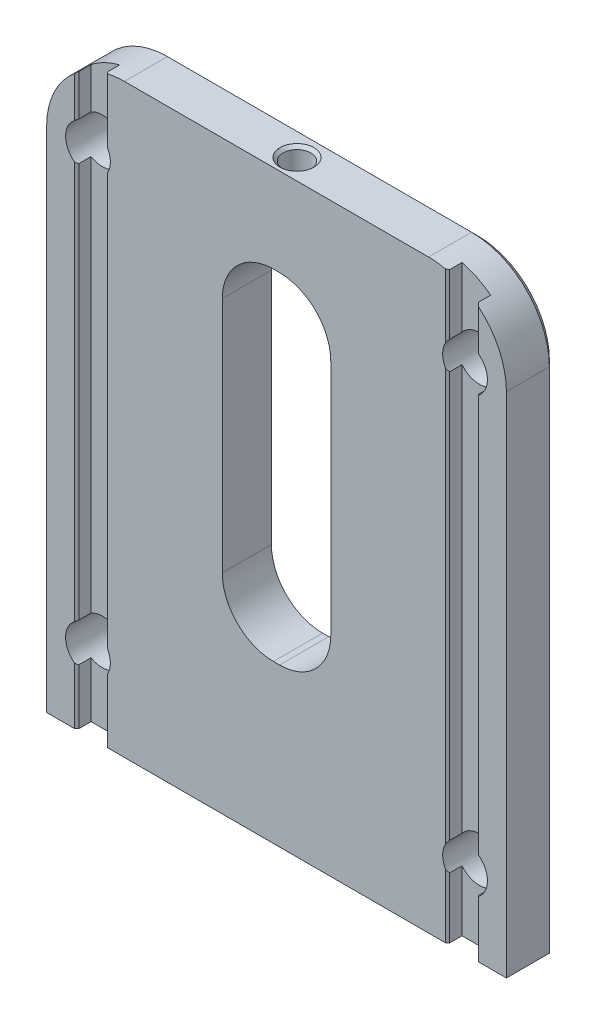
ISO-10303-21;
HEADER;
FILE_DESCRIPTION(('STEP AP214'),'2;1');
FILE_NAME('part.step','',(''),(''),'','','');
FILE_SCHEMA(('AUTOMOTIVE_DESIGN { 1 0 10303 214 1 1 1 1 }'));
ENDSEC;
DATA;
#1=APPLICATION_CONTEXT('core data for automotive mechanical design processes');
#2=APPLICATION_PROTOCOL_DEFINITION('international standard','automotive_design',2000,#1);
#3=PRODUCT_CONTEXT('',#1,'mechanical');
#4=PRODUCT('Part','Part','',(#3));
#5=PRODUCT_RELATED_PRODUCT_CATEGORY('part','',(#4));
#6=PRODUCT_DEFINITION_FORMATION('','',#4);
#7=PRODUCT_DEFINITION_CONTEXT('part definition',#1,'design');
#8=PRODUCT_DEFINITION('design','',#6,#7);
#9=PRODUCT_DEFINITION_SHAPE('','',#8);
#10=(LENGTH_UNIT() NAMED_UNIT(*) SI_UNIT(.MILLI.,.METRE.));
#11=(NAMED_UNIT(*) PLANE_ANGLE_UNIT() SI_UNIT($,.RADIAN.));
#12=(NAMED_UNIT(*) SI_UNIT($,.STERADIAN.) SOLID_ANGLE_UNIT());
#13=UNCERTAINTY_MEASURE_WITH_UNIT(LENGTH_MEASURE(1.E-05),#10,'distance_accuracy_value','');
#14=(GEOMETRIC_REPRESENTATION_CONTEXT(3) GLOBAL_UNCERTAINTY_ASSIGNED_CONTEXT((#13)) GLOBAL_UNIT_ASSIGNED_CONTEXT((#10,
#11,#12)) REPRESENTATION_CONTEXT('',''));
#15=CARTESIAN_POINT('',(0.,0.,0.));
#16=DIRECTION('',(0.,0.,1.));
#17=DIRECTION('',(1.,0.,0.));
#18=AXIS2_PLACEMENT_3D('',#15,#16,#17);
#19=CARTESIAN_POINT('',(-6.731,61.976,-163.461981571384));
#20=DIRECTION('',(0.,-1.,0.));
#21=DIRECTION('',(0.,0.,-1.));
#22=AXIS2_PLACEMENT_3D('',#19,#20,#21);
#23=PLANE('',#22);
#24=DIRECTION('',(0.,0.,1.));
#25=VECTOR('',#24,1.);
#26=CARTESIAN_POINT('',(0.381,61.976,-16.256));
#27=LINE('',#26,#25);
#28=CARTESIAN_POINT('',(0.381,61.976,-17.1113460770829));
#29=VERTEX_POINT('',#28);
#30=CARTESIAN_POINT('',(0.381,61.976,-16.7483440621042));
#31=VERTEX_POINT('',#30);
#32=EDGE_CURVE('E774',#29,#31,#27,.T.);
#33=ORIENTED_EDGE('',*,*,#32,.T.);
#34=CARTESIAN_POINT('',(0.,61.976,-18.796));
#35=DIRECTION('',(0.,-1.,0.));
#36=DIRECTION('',(0.,0.,-1.));
#37=AXIS2_PLACEMENT_3D('',#34,#35,#36);
#38=CIRCLE('',#37,2.0828);
#39=CARTESIAN_POINT('',(-0.381,61.976,-16.7483440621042));
#40=VERTEX_POINT('',#39);
#41=EDGE_CURVE('E740',#31,#40,#38,.T.);
#42=ORIENTED_EDGE('',*,*,#41,.T.);
#43=DIRECTION('',(0.,0.,1.));
#44=VECTOR('',#43,1.);
#45=CARTESIAN_POINT('',(-0.381,61.976,-22.352));
#46=LINE('',#45,#44);
#47=CARTESIAN_POINT('',(-0.381,61.976,-17.1113460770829));
#48=VERTEX_POINT('',#47);
#49=EDGE_CURVE('E771',#40,#48,#46,.F.);
#50=ORIENTED_EDGE('',*,*,#49,.T.);
#51=CARTESIAN_POINT('',(0.,61.976,-18.796));
#52=DIRECTION('',(0.,-1.,0.));
#53=DIRECTION('',(0.,0.,-1.));
#54=AXIS2_PLACEMENT_3D('',#51,#52,#53);
#55=CIRCLE('',#54,1.7272);
#56=EDGE_CURVE('E699',#48,#29,#55,.F.);
#57=ORIENTED_EDGE('',*,*,#56,.T.);
#58=EDGE_LOOP('',(#33,#42,#50,#57));
#59=FACE_BOUND('',#58,.T.);
#60=ADVANCED_FACE('F16',(#59),#23,.T.);
#61=CARTESIAN_POINT('',(-0.381000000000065,61.976,-20.4806539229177));
#62=VERTEX_POINT('',#61);
#63=CARTESIAN_POINT('',(-0.381,61.976,-20.8436559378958));
#64=VERTEX_POINT('',#63);
#65=EDGE_CURVE('E781',#62,#64,#46,.F.);
#66=ORIENTED_EDGE('',*,*,#65,.T.);
#67=CARTESIAN_POINT('',(0.,61.976,-18.796));
#68=DIRECTION('',(0.,-1.,0.));
#69=DIRECTION('',(0.,0.,-1.));
#70=AXIS2_PLACEMENT_3D('',#67,#68,#69);
#71=CIRCLE('',#70,2.0828);
#72=CARTESIAN_POINT('',(0.381,61.976,-20.8436559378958));
#73=VERTEX_POINT('',#72);
#74=EDGE_CURVE('E761',#64,#73,#71,.T.);
#75=ORIENTED_EDGE('',*,*,#74,.T.);
#76=CARTESIAN_POINT('',(0.381,61.976,-20.4806539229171));
#77=VERTEX_POINT('',#76);
#78=EDGE_CURVE('E1181',#73,#77,#27,.T.);
#79=ORIENTED_EDGE('',*,*,#78,.T.);
#80=EDGE_CURVE('E700',#77,#62,#55,.F.);
#81=ORIENTED_EDGE('',*,*,#80,.T.);
#82=EDGE_LOOP('',(#66,#75,#79,#81));
#83=FACE_BOUND('',#82,.T.);
#84=ADVANCED_FACE('F708',(#83),#23,.T.);
#85=CARTESIAN_POINT('',(0.381,55.626,-163.461981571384));
#86=DIRECTION('',(0.,0.,-1.));
#87=DIRECTION('',(-1.,0.,0.));
#88=AXIS2_PLACEMENT_3D('',#85,#86,#87);
#89=CYLINDRICAL_SURFACE('',#88,6.35);
#90=CARTESIAN_POINT('',(0.381,61.976,-16.7483440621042));
#91=CARTESIAN_POINT('',(0.437529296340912,61.9760039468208,-16.7588611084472));
#92=CARTESIAN_POINT('',(0.493592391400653,61.9752443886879,-16.7717171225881));
#93=CARTESIAN_POINT('',(0.604417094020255,61.9723098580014,-16.8019998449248));
#94=CARTESIAN_POINT('',(0.659179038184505,61.970135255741,-16.8194253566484));
#95=CARTESIAN_POINT('',(0.82066505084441,61.9616733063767,-16.878281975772));
#96=CARTESIAN_POINT('',(0.924948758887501,61.9534464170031,-16.9263606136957));
#97=CARTESIAN_POINT('',(1.12383473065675,61.9331959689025,-17.0386972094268));
#98=CARTESIAN_POINT('',(1.21844127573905,61.9211740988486,-17.1029479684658));
#99=CARTESIAN_POINT('',(1.39576017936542,61.8950349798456,-17.24587856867));
#100=CARTESIAN_POINT('',(1.47846856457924,61.8809170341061,-17.3245632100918));
#101=CARTESIAN_POINT('',(1.63195248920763,61.852065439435,-17.4966041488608));
#102=CARTESIAN_POINT('',(1.70235174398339,61.8373254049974,-17.5902952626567));
#103=CARTESIAN_POINT('',(1.82659794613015,61.8095924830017,-17.7883955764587));
#104=CARTESIAN_POINT('',(1.88043621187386,61.7966005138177,-17.8928103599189));
#105=CARTESIAN_POINT('',(1.97016756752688,61.7741058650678,-18.1101413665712));
#106=CARTESIAN_POINT('',(2.00595761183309,61.7646233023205,-18.2231022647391));
#107=CARTESIAN_POINT('',(2.0578318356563,61.7506628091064,-18.4535623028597));
#108=CARTESIAN_POINT('',(2.07396465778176,61.7461725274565,-18.5710494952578));
#109=CARTESIAN_POINT('',(2.08185563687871,61.7439705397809,-18.724004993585));
#110=CARTESIAN_POINT('',(2.08277553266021,61.7437128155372,-18.7591018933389));
#111=CARTESIAN_POINT('',(2.0827992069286,61.7437103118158,-18.7941824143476));
#112=B_SPLINE_CURVE_WITH_KNOTS('',3,(#90,#91,#92,#93,#94,#95,#96,#97,#98,#99,#100,#101,#102,
#103,#104,#105,#106,#107,#108,#109,#110,#111),.UNSPECIFIED.,.F.,.F.,(4,2,2,2,2,2,2,2,2,2,4),(0.,
0.172384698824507,0.344724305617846,0.688320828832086,1.03176467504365,1.37532294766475,
1.72802722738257,2.08091608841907,2.43579756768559,2.78979908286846,2.89507613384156),.UNSPECIFIED.);
#113=CARTESIAN_POINT('',(2.0827992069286,61.7437103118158,-18.7941824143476));
#114=VERTEX_POINT('',#113);
#115=EDGE_CURVE('E739',#31,#114,#112,.T.);
#116=ORIENTED_EDGE('',*,*,#115,.F.);
#117=ORIENTED_EDGE('',*,*,#32,.F.);
#118=CARTESIAN_POINT('',(0.,61.9645596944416,-17.0688));
#119=CARTESIAN_POINT('',(-0.096183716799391,61.9587764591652,-17.0688026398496));
#120=CARTESIAN_POINT('',(-0.192262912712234,61.9507837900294,-17.0768619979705));
#121=CARTESIAN_POINT('',(-0.381378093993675,61.9307871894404,-17.1087006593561));
#122=CARTESIAN_POINT('',(-0.47441213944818,61.9187807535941,-17.1324897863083));
#123=CARTESIAN_POINT('',(-0.654696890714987,61.8916310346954,-17.1948521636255));
#124=CARTESIAN_POINT('',(-0.741957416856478,61.8764932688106,-17.2333995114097));
#125=CARTESIAN_POINT('',(-0.908685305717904,61.8442338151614,-17.3240893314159));
#126=CARTESIAN_POINT('',(-0.988152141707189,61.8271119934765,-17.376232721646));
#127=CARTESIAN_POINT('',(-1.13948826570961,61.7917786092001,-17.494364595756));
#128=CARTESIAN_POINT('',(-1.21108439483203,61.7735499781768,-17.5606981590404));
#129=CARTESIAN_POINT('',(-1.34222883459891,61.7380869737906,-17.7046151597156));
#130=CARTESIAN_POINT('',(-1.40177548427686,61.7208527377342,-17.7822001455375));
#131=CARTESIAN_POINT('',(-1.50774493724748,61.6888583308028,-17.9476582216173));
#132=CARTESIAN_POINT('',(-1.55400879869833,61.6741289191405,-18.0356394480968));
#133=CARTESIAN_POINT('',(-1.6309088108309,61.6489870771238,-18.2187585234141));
#134=CARTESIAN_POINT('',(-1.66155048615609,61.6385731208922,-18.3138938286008));
#135=CARTESIAN_POINT('',(-1.70508936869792,61.6236031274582,-18.5043925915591));
#136=CARTESIAN_POINT('',(-1.71867317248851,61.6188209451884,-18.5995811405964));
#137=CARTESIAN_POINT('',(-1.72984948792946,61.6148942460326,-18.7909968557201));
#138=CARTESIAN_POINT('',(-1.72744630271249,61.615748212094,-18.8872237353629));
#139=CARTESIAN_POINT('',(-1.70718701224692,61.6228388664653,-19.0738132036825));
#140=CARTESIAN_POINT('',(-1.68996776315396,61.6288536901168,-19.1642545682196));
#141=CARTESIAN_POINT('',(-1.64155713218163,61.6453363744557,-19.3408835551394));
#142=CARTESIAN_POINT('',(-1.61036425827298,61.6558047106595,-19.4270707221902));
#143=CARTESIAN_POINT('',(-1.53433381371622,61.6803878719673,-19.5945292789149));
#144=CARTESIAN_POINT('',(-1.48926082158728,61.694564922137,-19.6756843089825));
#145=CARTESIAN_POINT('',(-1.38696984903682,61.7251496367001,-19.8294744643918));
#146=CARTESIAN_POINT('',(-1.32974859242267,61.7415579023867,-19.9021072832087));
#147=CARTESIAN_POINT('',(-1.20137305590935,61.7760590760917,-20.0407063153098));
#148=CARTESIAN_POINT('',(-1.12965535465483,61.7941952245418,-20.1061407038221));
#149=CARTESIAN_POINT('',(-0.976171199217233,61.8297719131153,-20.2241751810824));
#150=CARTESIAN_POINT('',(-0.894403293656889,61.8472123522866,-20.276773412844));
#151=CARTESIAN_POINT('',(-0.72128736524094,61.8802270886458,-20.368491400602));
#152=CARTESIAN_POINT('',(-0.62979220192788,61.8957616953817,-20.4073487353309));
#153=CARTESIAN_POINT('',(-0.4410124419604,61.923291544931,-20.4688949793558));
#154=CARTESIAN_POINT('',(-0.343729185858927,61.9352876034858,-20.4915876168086));
#155=CARTESIAN_POINT('',(-0.149334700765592,61.9545454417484,-20.5194439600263));
#156=CARTESIAN_POINT('',(-0.0523118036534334,61.9619425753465,-20.5251297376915));
#157=CARTESIAN_POINT('',(0.141543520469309,61.9722253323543,-20.520117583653));
#158=CARTESIAN_POINT('',(0.23837598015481,61.9751118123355,-20.5094227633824));
#159=CARTESIAN_POINT('',(0.425952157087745,61.9765129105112,-20.4724970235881));
#160=CARTESIAN_POINT('',(0.516791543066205,61.9751592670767,-20.446754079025));
#161=CARTESIAN_POINT('',(0.692964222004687,61.9689451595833,-20.3808865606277));
#162=CARTESIAN_POINT('',(0.778297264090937,61.9640845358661,-20.3407613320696));
#163=CARTESIAN_POINT('',(0.941784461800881,61.9517253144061,-20.2469353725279));
#164=CARTESIAN_POINT('',(1.01987933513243,61.9442070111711,-20.1931341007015));
#165=CARTESIAN_POINT('',(1.16614976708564,61.9277034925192,-20.073591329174));
#166=CARTESIAN_POINT('',(1.23432370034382,61.918718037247,-20.0078478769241));
#167=CARTESIAN_POINT('',(1.36067042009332,61.9003076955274,-19.8642597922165));
#168=CARTESIAN_POINT('',(1.41853210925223,61.890877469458,-19.7861417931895));
#169=CARTESIAN_POINT('',(1.5204031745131,61.8731548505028,-19.6212200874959));
#170=CARTESIAN_POINT('',(1.56441231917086,61.8648624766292,-19.5344162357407));
#171=CARTESIAN_POINT('',(1.63743543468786,61.8505697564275,-19.3541370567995));
#172=CARTESIAN_POINT('',(1.66639164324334,61.8445782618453,-19.2606375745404));
#173=CARTESIAN_POINT('',(1.70812496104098,61.8358068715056,-19.0699536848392));
#174=CARTESIAN_POINT('',(1.72090465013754,61.8330264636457,-18.972769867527));
#175=CARTESIAN_POINT('',(1.72977132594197,61.8311055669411,-18.7796002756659));
#176=CARTESIAN_POINT('',(1.72619342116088,61.8318920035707,-18.6836304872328));
#177=CARTESIAN_POINT('',(1.70322696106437,61.8368252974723,-18.4936946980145));
#178=CARTESIAN_POINT('',(1.68383860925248,61.8409721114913,-18.3997286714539));
#179=CARTESIAN_POINT('',(1.63001338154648,61.8520106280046,-18.2169433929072));
#180=CARTESIAN_POINT('',(1.59565779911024,61.8588874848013,-18.1280992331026));
#181=CARTESIAN_POINT('',(1.51291924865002,61.874441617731,-17.9573722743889));
#182=CARTESIAN_POINT('',(1.46453457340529,61.8831191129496,-17.8754903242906));
#183=CARTESIAN_POINT('',(1.35396787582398,61.9012708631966,-17.7192799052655));
#184=CARTESIAN_POINT('',(1.29153348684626,61.9107574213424,-17.6451314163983));
#185=CARTESIAN_POINT('',(1.15509506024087,61.9290154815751,-17.5082443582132));
#186=CARTESIAN_POINT('',(1.08108917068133,61.9377868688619,-17.4455076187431));
#187=CARTESIAN_POINT('',(0.922810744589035,61.9533462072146,-17.3327288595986));
#188=CARTESIAN_POINT('',(0.838456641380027,61.9601167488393,-17.2827987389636));
#189=CARTESIAN_POINT('',(0.662390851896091,61.9703730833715,-17.1978773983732));
#190=CARTESIAN_POINT('',(0.570684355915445,61.9738611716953,-17.1628757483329));
#191=CARTESIAN_POINT('',(0.399270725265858,61.9764467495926,-17.1136512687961));
#192=CARTESIAN_POINT('',(0.320303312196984,61.97621063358,-17.0968510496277));
#193=CARTESIAN_POINT('',(0.160866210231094,61.972684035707,-17.0744245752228));
#194=CARTESIAN_POINT('',(0.0803965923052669,61.9693936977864,-17.0687977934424));
#195=CARTESIAN_POINT('',(0.,61.9645596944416,-17.0688));
#196=B_SPLINE_CURVE_WITH_KNOTS('',3,(#118,#119,#120,#121,#122,#123,#124,#125,#126,#127,#128,
#129,#130,#131,#132,#133,#134,#135,#136,#137,#138,#139,#140,#141,#142,#143,#144,#145,#146,#147,
#148,#149,#150,#151,#152,#153,#154,#155,#156,#157,#158,#159,#160,#161,#162,#163,#164,#165,#166,
#167,#168,#169,#170,#171,#172,#173,#174,#175,#176,#177,#178,#179,#180,#181,#182,#183,#184,#185,
#186,#187,#188,#189,#190,#191,#192,#193,#194,#195),.UNSPECIFIED.,.T.,.F.,(4,2,2,2,2,2,2,2,2,2,2,
2,2,2,2,2,2,2,2,2,2,2,2,2,2,2,2,2,2,2,2,2,2,2,2,2,2,2,4),(0.,0.288771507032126,
0.577723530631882,0.866170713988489,1.15463737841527,1.45113618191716,1.74767582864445,
2.0476285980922,2.34747521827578,2.63481952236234,2.92208648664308,3.19758933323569,
3.47312160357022,3.75361176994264,4.03417767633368,4.32911038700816,4.62408573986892,
4.92442371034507,5.22469238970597,5.5156437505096,5.80653985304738,6.08848861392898,
6.37045021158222,6.65454786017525,6.93869200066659,7.2303281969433,7.52196926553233,
7.81472133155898,8.10742670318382,8.39416277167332,8.68089514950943,8.96608920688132,
9.25131798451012,9.54214985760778,9.83302832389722,10.1263678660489,10.4195021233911,
10.6608874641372,10.9022614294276),.UNSPECIFIED.);
#197=EDGE_CURVE('E692',#77,#29,#196,.T.);
#198=ORIENTED_EDGE('',*,*,#197,.F.);
#199=ORIENTED_EDGE('',*,*,#78,.F.);
#200=CARTESIAN_POINT('',(2.0828,61.7437100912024,-18.796));
#201=CARTESIAN_POINT('',(2.08280089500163,61.7437049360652,-18.853549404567));
#202=CARTESIAN_POINT('',(2.08041328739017,61.7443745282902,-18.9110700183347));
#203=CARTESIAN_POINT('',(2.07089655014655,61.747011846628,-19.0256762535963));
#204=CARTESIAN_POINT('',(2.06376837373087,61.7489793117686,-19.0827619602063));
#205=CARTESIAN_POINT('',(2.03538265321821,61.7567361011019,-19.2524893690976));
#206=CARTESIAN_POINT('',(2.00712340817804,61.7643804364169,-19.363957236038));
#207=CARTESIAN_POINT('',(1.93286325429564,61.7835701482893,-19.5803476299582));
#208=CARTESIAN_POINT('',(1.88686591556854,61.7951147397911,-19.6852714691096));
#209=CARTESIAN_POINT('',(1.77847473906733,61.8205664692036,-19.8859963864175));
#210=CARTESIAN_POINT('',(1.7160764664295,61.8344742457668,-19.981794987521));
#211=CARTESIAN_POINT('',(1.57490770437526,61.8631772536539,-20.163957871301));
#212=CARTESIAN_POINT('',(1.4957912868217,61.8779855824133,-20.2500520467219));
#213=CARTESIAN_POINT('',(1.32408689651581,61.9061785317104,-20.4079731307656));
#214=CARTESIAN_POINT('',(1.23149081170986,61.9195622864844,-20.4797913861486));
#215=CARTESIAN_POINT('',(1.03435029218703,61.9430865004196,-20.6076612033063));
#216=CARTESIAN_POINT('',(0.929701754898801,61.9531953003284,-20.6635582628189));
#217=CARTESIAN_POINT('',(0.712296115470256,61.9682799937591,-20.7567659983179));
#218=CARTESIAN_POINT('',(0.599560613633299,61.9732690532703,-20.7941242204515));
#219=CARTESIAN_POINT('',(0.450233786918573,61.9757185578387,-20.8298659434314));
#220=CARTESIAN_POINT('',(0.415691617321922,61.9760051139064,-20.8372082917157));
#221=CARTESIAN_POINT('',(0.381,61.976,-20.8436559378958));
#222=B_SPLINE_CURVE_WITH_KNOTS('',3,(#200,#201,#202,#203,#204,#205,#206,#207,#208,#209,#210,
#211,#212,#213,#214,#215,#216,#217,#218,#219,#220,#221),.UNSPECIFIED.,.F.,.F.,(4,2,2,2,2,2,2,2,
2,2,4),(0.,0.172538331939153,0.345041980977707,0.688995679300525,1.03288018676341,
1.37685777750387,1.72880742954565,2.08096976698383,2.43644139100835,2.79099657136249,
2.89688792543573),.UNSPECIFIED.);
#223=CARTESIAN_POINT('',(2.0828,61.7437100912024,-18.796));
#224=VERTEX_POINT('',#223);
#225=EDGE_CURVE('E732',#224,#73,#222,.T.);
#226=ORIENTED_EDGE('',*,*,#225,.F.);
#227=CARTESIAN_POINT('',(0.381,55.626,-18.796));
#228=DIRECTION('',(0.,0.,1.));
#229=DIRECTION('',(1.,0.,0.));
#230=AXIS2_PLACEMENT_3D('',#227,#228,#229);
#231=CIRCLE('',#230,6.35);
#232=CARTESIAN_POINT('',(2.083054,61.7436394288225,-18.796));
#233=VERTEX_POINT('',#232);
#234=EDGE_CURVE('E1225',#233,#224,#231,.T.);
#235=ORIENTED_EDGE('',*,*,#234,.F.);
#236=CARTESIAN_POINT('',(2.083054,61.7436394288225,-18.796));
#237=CARTESIAN_POINT('',(2.08305489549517,61.7436342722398,-18.8535560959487));
#238=CARTESIAN_POINT('',(2.08066702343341,61.7443040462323,-18.9110833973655));
#239=CARTESIAN_POINT('',(2.07114923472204,61.7469420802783,-19.0257029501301));
#240=CARTESIAN_POINT('',(2.06402027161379,61.7489100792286,-19.0827952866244));
#241=CARTESIAN_POINT('',(2.03563143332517,61.7566689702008,-19.2525423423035));
#242=CARTESIAN_POINT('',(2.00736909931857,61.7643153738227,-19.3640230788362));
#243=CARTESIAN_POINT('',(1.93310089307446,61.7835102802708,-19.5804384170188));
#244=CARTESIAN_POINT('',(1.88709859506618,61.7950579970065,-19.685374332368));
#245=CARTESIAN_POINT('',(1.77869578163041,61.8205166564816,-19.8861224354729));
#246=CARTESIAN_POINT('',(1.71629082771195,61.8344282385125,-19.98193214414));
#247=CARTESIAN_POINT('',(1.57510646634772,61.8631393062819,-20.1641169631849));
#248=CARTESIAN_POINT('',(1.49598098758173,61.8779518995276,-20.2502218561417));
#249=CARTESIAN_POINT('',(1.32425679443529,61.9061531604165,-20.4081627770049));
#250=CARTESIAN_POINT('',(1.23164996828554,61.9195409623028,-20.4799901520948));
#251=CARTESIAN_POINT('',(1.03448596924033,61.9430726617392,-20.6078767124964));
#252=CARTESIAN_POINT('',(0.929824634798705,61.9531848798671,-20.6637813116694));
#253=CARTESIAN_POINT('',(0.712392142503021,61.9682752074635,-20.7570018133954));
#254=CARTESIAN_POINT('',(0.599642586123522,61.9732664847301,-20.7943652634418));
#255=CARTESIAN_POINT('',(0.450279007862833,61.9757181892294,-20.8301164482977));
#256=CARTESIAN_POINT('',(0.415714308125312,61.9760051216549,-20.8374632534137));
#257=CARTESIAN_POINT('',(0.381,61.976,-20.8439142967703));
#258=B_SPLINE_CURVE_WITH_KNOTS('',3,(#236,#237,#238,#239,#240,#241,#242,#243,#244,#245,#246,
#247,#248,#249,#250,#251,#252,#253,#254,#255,#256,#257),.UNSPECIFIED.,.F.,.F.,(4,2,2,2,2,2,2,2,
2,2,4),(0.,0.172558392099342,0.345082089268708,0.689075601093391,1.03299984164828,
1.37701724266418,1.72901005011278,2.08121553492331,2.43673213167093,2.79133225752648,
2.897292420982),.UNSPECIFIED.);
#259=CARTESIAN_POINT('',(0.381,61.976,-20.8439142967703));
#260=VERTEX_POINT('',#259);
#261=EDGE_CURVE('E717',#233,#260,#258,.T.);
#262=ORIENTED_EDGE('',*,*,#261,.T.);
#263=CARTESIAN_POINT('',(0.381,61.976,-22.352));
#264=VERTEX_POINT('',#263);
#265=EDGE_CURVE('E1182',#264,#260,#27,.T.);
#266=ORIENTED_EDGE('',*,*,#265,.F.);
#267=CARTESIAN_POINT('',(0.381,55.626,-22.352));
#268=DIRECTION('',(0.,0.,-1.));
#269=DIRECTION('',(-1.,0.,0.));
#270=AXIS2_PLACEMENT_3D('',#267,#268,#269);
#271=CIRCLE('',#270,6.35);
#272=CARTESIAN_POINT('',(6.731,55.626,-22.352));
#273=VERTEX_POINT('',#272);
#274=EDGE_CURVE('E1196',#273,#264,#271,.F.);
#275=ORIENTED_EDGE('',*,*,#274,.F.);
#276=DIRECTION('',(0.,0.,1.));
#277=VECTOR('',#276,1.);
#278=CARTESIAN_POINT('',(6.731,55.626,-22.352));
#279=LINE('',#278,#277);
#280=CARTESIAN_POINT('',(6.731,55.626,-16.256));
#281=VERTEX_POINT('',#280);
#282=EDGE_CURVE('E795',#281,#273,#279,.F.);
#283=ORIENTED_EDGE('',*,*,#282,.F.);
#284=CARTESIAN_POINT('',(0.381,55.626,-16.256));
#285=DIRECTION('',(0.,0.,1.));
#286=DIRECTION('',(1.,0.,0.));
#287=AXIS2_PLACEMENT_3D('',#284,#285,#286);
#288=CIRCLE('',#287,6.35);
#289=CARTESIAN_POINT('',(0.381,61.976,-16.256));
#290=VERTEX_POINT('',#289);
#291=EDGE_CURVE('E1180',#290,#281,#288,.F.);
#292=ORIENTED_EDGE('',*,*,#291,.F.);
#293=CARTESIAN_POINT('',(0.381,61.976,-16.7480857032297));
#294=VERTEX_POINT('',#293);
#295=EDGE_CURVE('E785',#294,#290,#27,.T.);
#296=ORIENTED_EDGE('',*,*,#295,.F.);
#297=CARTESIAN_POINT('',(0.381,61.976,-16.7480857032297));
#298=CARTESIAN_POINT('',(0.437536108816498,61.9760039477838,-16.758602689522));
#299=CARTESIAN_POINT('',(0.49360601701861,61.9752442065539,-16.7714589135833));
#300=CARTESIAN_POINT('',(0.604444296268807,61.9723089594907,-16.8017425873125));
#301=CARTESIAN_POINT('',(0.659213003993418,61.9701338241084,-16.8191688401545));
#302=CARTESIAN_POINT('',(0.820719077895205,61.9616697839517,-16.8780284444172));
#303=CARTESIAN_POINT('',(0.925015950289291,61.9534408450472,-16.9261100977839));
#304=CARTESIAN_POINT('',(1.12392749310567,61.9331852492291,-17.038454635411));
#305=CARTESIAN_POINT('',(1.21854644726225,61.9211602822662,-17.102710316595));
#306=CARTESIAN_POINT('',(1.39588923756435,61.8950142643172,-17.2456525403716));
#307=CARTESIAN_POINT('',(1.47860909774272,61.8808925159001,-17.3243438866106));
#308=CARTESIAN_POINT('',(1.63211565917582,61.8520328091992,-17.4964006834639));
#309=CARTESIAN_POINT('',(1.70252594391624,61.8372884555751,-17.5901010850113));
#310=CARTESIAN_POINT('',(1.8267925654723,61.80954709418,-17.7882217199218));
#311=CARTESIAN_POINT('',(1.88064022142,61.7965510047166,-17.8926475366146));
#312=CARTESIAN_POINT('',(1.97038869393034,61.7740487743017,-18.1100026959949));
#313=CARTESIAN_POINT('',(2.00618637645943,61.7645627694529,-18.2229767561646));
#314=CARTESIAN_POINT('',(2.05807347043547,61.7505966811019,-18.4534643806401));
#315=CARTESIAN_POINT('',(2.07421152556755,61.7461042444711,-18.5709659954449));
#316=CARTESIAN_POINT('',(2.08210855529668,61.7439002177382,-18.7239590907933));
#317=CARTESIAN_POINT('',(2.08302952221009,61.7436421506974,-18.7590788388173));
#318=CARTESIAN_POINT('',(2.08305320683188,61.7436396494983,-18.7941821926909));
#319=B_SPLINE_CURVE_WITH_KNOTS('',3,(#297,#298,#299,#300,#301,#302,#303,#304,#305,#306,#307,
#308,#309,#310,#311,#312,#313,#314,#315,#316,#317,#318),.UNSPECIFIED.,.F.,.F.,(4,2,2,2,2,2,2,2,
2,2,4),(0.,0.172404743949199,0.344764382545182,0.688400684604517,1.03188421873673,
1.3754822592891,1.72822979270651,2.08116189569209,2.43608835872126,2.79013483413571,
2.89548040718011),.UNSPECIFIED.);
#320=CARTESIAN_POINT('',(2.08305320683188,61.7436396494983,-18.7941821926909));
#321=VERTEX_POINT('',#320);
#322=EDGE_CURVE('E725',#294,#321,#319,.T.);
#323=ORIENTED_EDGE('',*,*,#322,.T.);
#324=CARTESIAN_POINT('',(0.381,55.626,-18.7956675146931));
#325=DIRECTION('',(-0.000872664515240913,0.,0.99999961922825));
#326=DIRECTION('',(-0.99999961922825,0.,-0.000872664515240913));
#327=AXIS2_PLACEMENT_3D('',#324,#325,#326);
#328=ELLIPSE('',#327,6.35000241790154,6.35);
#329=EDGE_CURVE('E425',#114,#321,#328,.F.);
#330=ORIENTED_EDGE('',*,*,#329,.F.);
#331=EDGE_LOOP('',(#116,#117,#198,#199,#226,#235,#262,#266,#275,#283,#292,#296,#323,#330));
#332=FACE_BOUND('',#331,.T.);
#333=ADVANCED_FACE('F703',(#332),#89,.F.);
#334=CARTESIAN_POINT('',(-0.381,55.626,-163.461981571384));
#335=DIRECTION('',(0.,0.,-1.));
#336=DIRECTION('',(-1.,0.,0.));
#337=AXIS2_PLACEMENT_3D('',#334,#335,#336);
#338=CYLINDRICAL_SURFACE('',#337,6.35);
#339=CARTESIAN_POINT('',(-0.381,61.976,-20.8436559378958));
#340=CARTESIAN_POINT('',(-0.43753081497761,61.9760039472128,-20.8331386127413));
#341=CARTESIAN_POINT('',(-0.493595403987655,61.975244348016,-20.8202821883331));
#342=CARTESIAN_POINT('',(-0.604423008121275,61.9723096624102,-20.789998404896));
#343=CARTESIAN_POINT('',(-0.659186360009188,61.9701349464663,-20.7725722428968));
#344=CARTESIAN_POINT('',(-0.820670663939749,61.9616728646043,-20.7137154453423));
#345=CARTESIAN_POINT('',(-0.92495144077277,61.9534461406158,-20.6656379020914));
#346=CARTESIAN_POINT('',(-1.12382909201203,61.9331965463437,-20.5533059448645));
#347=CARTESIAN_POINT('',(-1.21843053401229,61.9211754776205,-20.4890592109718));
#348=CARTESIAN_POINT('',(-1.39575079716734,61.8950365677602,-20.3461304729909));
#349=CARTESIAN_POINT('',(-1.47846429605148,61.8809177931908,-20.2674420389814));
#350=CARTESIAN_POINT('',(-1.63197155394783,61.8520619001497,-20.0953740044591));
#351=CARTESIAN_POINT('',(-1.70238620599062,61.8373183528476,-20.0016570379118));
#352=CARTESIAN_POINT('',(-1.82662465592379,61.8095858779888,-19.8035545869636));
#353=CARTESIAN_POINT('',(-1.88044791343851,61.7965970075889,-19.6991687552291));
#354=CARTESIAN_POINT('',(-1.97011774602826,61.7741189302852,-19.4819718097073));
#355=CARTESIAN_POINT('',(-2.00587687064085,61.7646468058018,-19.3691226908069));
#356=CARTESIAN_POINT('',(-2.05779871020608,61.7506699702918,-19.1387179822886));
#357=CARTESIAN_POINT('',(-2.07396725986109,61.7461637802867,-19.0211638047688));
#358=CARTESIAN_POINT('',(-2.0859269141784,61.7428422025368,-18.7888239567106));
#359=CARTESIAN_POINT('',(-2.0823693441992,61.743844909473,-18.6740740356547));
#360=CARTESIAN_POINT('',(-2.05651142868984,61.7509765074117,-18.4468746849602));
#361=CARTESIAN_POINT('',(-2.03421116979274,61.7571053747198,-18.3344252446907));
#362=CARTESIAN_POINT('',(-1.97192673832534,61.7735578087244,-18.1160479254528));
#363=CARTESIAN_POINT('',(-1.93211301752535,61.7838408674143,-18.0100681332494));
#364=CARTESIAN_POINT('',(-1.8360381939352,61.8072456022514,-17.8061898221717));
#365=CARTESIAN_POINT('',(-1.77977475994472,61.8203676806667,-17.7082924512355));
#366=CARTESIAN_POINT('',(-1.65031625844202,61.8482056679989,-17.5200850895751));
#367=CARTESIAN_POINT('',(-1.57665073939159,61.8629583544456,-17.430104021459));
#368=CARTESIAN_POINT('',(-1.41528676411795,61.8917365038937,-17.2635286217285));
#369=CARTESIAN_POINT('',(-1.32758206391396,61.9057616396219,-17.1869402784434));
#370=CARTESIAN_POINT('',(-1.13879889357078,61.9313521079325,-17.0480979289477));
#371=CARTESIAN_POINT('',(-1.03751781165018,61.9428713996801,-16.9861107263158));
#372=CARTESIAN_POINT('',(-0.825647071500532,61.9612998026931,-16.8801893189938));
#373=CARTESIAN_POINT('',(-0.715075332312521,61.9682175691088,-16.8362212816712));
#374=CARTESIAN_POINT('',(-0.565365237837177,61.9734281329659,-16.7910403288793));
#375=CARTESIAN_POINT('',(-0.528799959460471,61.9743869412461,-16.7810889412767));
#376=CARTESIAN_POINT('',(-0.455224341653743,61.9756721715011,-16.7632055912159));
#377=CARTESIAN_POINT('',(-0.418214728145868,61.9759995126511,-16.7552707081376));
#378=CARTESIAN_POINT('',(-0.381,61.976,-16.7483440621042));
#379=B_SPLINE_CURVE_WITH_KNOTS('',3,(#339,#340,#341,#342,#343,#344,#345,#346,#347,#348,#349,
#350,#351,#352,#353,#354,#355,#356,#357,#358,#359,#360,#361,#362,#363,#364,#365,#366,#367,#368,
#369,#370,#371,#372,#373,#374,#375,#376,#377,#378),.UNSPECIFIED.,.F.,.F.,(4,2,2,2,2,2,2,2,2,2,2,
2,2,2,2,2,2,2,2,4),(0.,0.172389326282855,0.344733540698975,0.688320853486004,1.03174527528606,
1.37532297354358,1.72811380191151,2.08091611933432,2.4354104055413,2.78979908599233,
3.1325575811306,3.47531449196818,3.81480684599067,4.15434733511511,4.50440448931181,
4.85461776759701,5.21080504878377,5.56632045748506,5.67999802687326,5.79350999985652),.UNSPECIFIED.);
#380=EDGE_CURVE('E756',#64,#40,#379,.T.);
#381=ORIENTED_EDGE('',*,*,#380,.F.);
#382=ORIENTED_EDGE('',*,*,#65,.F.);
#383=CARTESIAN_POINT('',(0.,61.9645596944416,-17.0688));
#384=CARTESIAN_POINT('',(-0.0943401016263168,61.9702294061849,-17.0688015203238));
#385=CARTESIAN_POINT('',(-0.188824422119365,61.9737757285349,-17.0765540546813));
#386=CARTESIAN_POINT('',(-0.375331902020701,61.9766831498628,-17.1074249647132));
#387=CARTESIAN_POINT('',(-0.46735435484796,61.9760430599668,-17.1305477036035));
#388=CARTESIAN_POINT('',(-0.646208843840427,61.9710899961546,-17.1914589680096));
#389=CARTESIAN_POINT('',(-0.733045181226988,61.9667801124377,-17.2292351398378));
#390=CARTESIAN_POINT('',(-0.899249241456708,61.9553654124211,-17.3183446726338));
#391=CARTESIAN_POINT('',(-0.978616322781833,61.9482603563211,-17.3696791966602));
#392=CARTESIAN_POINT('',(-1.12893061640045,61.9322591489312,-17.4853284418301));
#393=CARTESIAN_POINT('',(-1.1997365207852,61.9233381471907,-17.5498232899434));
#394=CARTESIAN_POINT('',(-1.32972221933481,61.9050718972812,-17.6895786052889));
#395=CARTESIAN_POINT('',(-1.3889005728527,61.895726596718,-17.7648404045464));
#396=CARTESIAN_POINT('',(-1.49518250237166,61.8777255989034,-17.9258579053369));
#397=CARTESIAN_POINT('',(-1.54200550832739,61.8690885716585,-18.0118012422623));
#398=CARTESIAN_POINT('',(-1.62053467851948,61.853974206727,-18.1905157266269));
#399=CARTESIAN_POINT('',(-1.65224212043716,61.8474966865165,-18.2832862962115));
#400=CARTESIAN_POINT('',(-1.69932164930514,61.8376911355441,-18.4721131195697));
#401=CARTESIAN_POINT('',(-1.71484581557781,61.8343338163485,-18.5681298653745));
#402=CARTESIAN_POINT('',(-1.72957284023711,61.8311520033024,-18.7614592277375));
#403=CARTESIAN_POINT('',(-1.72877777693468,61.8313270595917,-18.8587716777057));
#404=CARTESIAN_POINT('',(-1.71106974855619,61.835145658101,-19.0499800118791));
#405=CARTESIAN_POINT('',(-1.69446192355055,61.8387235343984,-19.1439057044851));
#406=CARTESIAN_POINT('',(-1.64609690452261,61.8487513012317,-19.327608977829));
#407=CARTESIAN_POINT('',(-1.61433871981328,61.8552013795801,-19.4173862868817));
#408=CARTESIAN_POINT('',(-1.5363303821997,61.870140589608,-19.5910049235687));
#409=CARTESIAN_POINT('',(-1.48997670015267,61.8786441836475,-19.6747984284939));
#410=CARTESIAN_POINT('',(-1.38413591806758,61.8964936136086,-19.8335407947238));
#411=CARTESIAN_POINT('',(-1.32464698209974,61.9058395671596,-19.9084884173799));
#412=CARTESIAN_POINT('',(-1.19277214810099,61.9242566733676,-20.0489891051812));
#413=CARTESIAN_POINT('',(-1.12015055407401,61.9333184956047,-20.1143224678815));
#414=CARTESIAN_POINT('',(-0.964808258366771,61.9495872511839,-20.2319153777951));
#415=CARTESIAN_POINT('',(-0.882087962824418,61.9567942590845,-20.2841754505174));
#416=CARTESIAN_POINT('',(-0.709298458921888,61.9680948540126,-20.3738266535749));
#417=CARTESIAN_POINT('',(-0.619270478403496,61.9722047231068,-20.4112950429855));
#418=CARTESIAN_POINT('',(-0.434116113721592,61.9764520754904,-20.4705766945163));
#419=CARTESIAN_POINT('',(-0.338990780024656,61.9765903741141,-20.492393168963));
#420=CARTESIAN_POINT('',(-0.149080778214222,61.9724553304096,-20.5193541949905));
#421=CARTESIAN_POINT('',(-0.0543538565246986,61.968298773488,-20.5249251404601));
#422=CARTESIAN_POINT('',(0.134450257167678,61.9557521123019,-20.5205461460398));
#423=CARTESIAN_POINT('',(0.22852746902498,61.9473621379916,-20.5105966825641));
#424=CARTESIAN_POINT('',(0.412962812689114,61.9268490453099,-20.47571764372));
#425=CARTESIAN_POINT('',(0.503336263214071,61.9147435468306,-20.4508582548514));
#426=CARTESIAN_POINT('',(0.678508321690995,61.8876137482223,-20.3870811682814));
#427=CARTESIAN_POINT('',(0.763305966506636,61.8725889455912,-20.348161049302));
#428=CARTESIAN_POINT('',(0.92789790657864,61.8402215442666,-20.2559341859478));
#429=CARTESIAN_POINT('',(1.0074442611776,61.8228200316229,-20.2022057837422));
#430=CARTESIAN_POINT('',(1.15651812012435,61.7875271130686,-20.0824037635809));
#431=CARTESIAN_POINT('',(1.22604309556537,61.7696355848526,-20.016327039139));
#432=CARTESIAN_POINT('',(1.35529775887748,61.7343877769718,-19.8712267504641));
#433=CARTESIAN_POINT('',(1.41466146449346,61.7170647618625,-19.7918681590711));
#434=CARTESIAN_POINT('',(1.51915807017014,61.6852816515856,-19.6237497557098));
#435=CARTESIAN_POINT('',(1.56429280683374,61.6708211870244,-19.5349911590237));
#436=CARTESIAN_POINT('',(1.63808580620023,61.646571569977,-19.3522517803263));
#437=CARTESIAN_POINT('',(1.66704170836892,61.6366986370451,-19.2584027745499));
#438=CARTESIAN_POINT('',(1.708656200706,61.6223599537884,-19.0667704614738));
#439=CARTESIAN_POINT('',(1.72132153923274,61.617891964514,-18.9689888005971));
#440=CARTESIAN_POINT('',(1.72961805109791,61.6149736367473,-18.7776732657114));
#441=CARTESIAN_POINT('',(1.72609166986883,61.6162256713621,-18.684179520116));
#442=CARTESIAN_POINT('',(1.70405570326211,61.6239310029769,-18.4992028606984));
#443=CARTESIAN_POINT('',(1.68554667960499,61.6303841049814,-18.407719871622));
#444=CARTESIAN_POINT('',(1.63453467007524,61.6476963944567,-18.2303722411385));
#445=CARTESIAN_POINT('',(1.60219719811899,61.6585033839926,-18.1444545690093));
#446=CARTESIAN_POINT('',(1.52459719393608,61.6834626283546,-17.9792007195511));
#447=CARTESIAN_POINT('',(1.47933204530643,61.6976155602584,-17.8998658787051));
#448=CARTESIAN_POINT('',(1.37487577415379,61.7286624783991,-17.7462685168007));
#449=CARTESIAN_POINT('',(1.31516098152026,61.7456494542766,-17.6723810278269));
#450=CARTESIAN_POINT('',(1.18454678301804,61.7803581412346,-17.5354334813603));
#451=CARTESIAN_POINT('',(1.11364362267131,61.7980800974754,-17.472377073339));
#452=CARTESIAN_POINT('',(0.959292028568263,61.8334654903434,-17.356322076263));
#453=CARTESIAN_POINT('',(0.875452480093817,61.8510976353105,-17.3038327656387));
#454=CARTESIAN_POINT('',(0.699699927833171,61.8839996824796,-17.2137934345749));
#455=CARTESIAN_POINT('',(0.607790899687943,61.8992707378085,-17.1762361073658));
#456=CARTESIAN_POINT('',(0.430524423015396,61.9244837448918,-17.1210804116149));
#457=CARTESIAN_POINT('',(0.345826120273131,61.9348569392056,-17.1015475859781));
#458=CARTESIAN_POINT('',(0.174125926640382,61.9522765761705,-17.0754078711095));
#459=CARTESIAN_POINT('',(0.0871244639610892,61.959323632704,-17.0687985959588));
#460=CARTESIAN_POINT('',(0.,61.9645596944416,-17.0688));
#461=B_SPLINE_CURVE_WITH_KNOTS('',3,(#383,#384,#385,#386,#387,#388,#389,#390,#391,#392,#393,
#394,#395,#396,#397,#398,#399,#400,#401,#402,#403,#404,#405,#406,#407,#408,#409,#410,#411,#412,
#413,#414,#415,#416,#417,#418,#419,#420,#421,#422,#423,#424,#425,#426,#427,#428,#429,#430,#431,
#432,#433,#434,#435,#436,#437,#438,#439,#440,#441,#442,#443,#444,#445,#446,#447,#448,#449,#450,
#451,#452,#453,#454,#455,#456,#457,#458,#459,#460),.UNSPECIFIED.,.T.,.F.,(4,2,2,2,2,2,2,2,2,2,2,
2,2,2,2,2,2,2,2,2,2,2,2,2,2,2,2,2,2,2,2,2,2,2,2,2,2,2,4),(0.,0.283217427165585,
0.566515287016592,0.849574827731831,1.13265865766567,1.41991396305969,1.70720483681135,
2.00054661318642,2.29386358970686,2.58439862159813,2.87489665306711,3.15990017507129,
3.44492233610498,3.73201358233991,4.0191449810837,4.31206142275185,4.60496608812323,
4.89631996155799,5.18761402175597,5.47119050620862,5.75475828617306,6.03700157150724,
6.31929348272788,6.61064579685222,6.90207150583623,7.20243860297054,7.50276691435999,
7.79737107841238,8.09185316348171,8.37119230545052,8.65052097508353,8.92659600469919,
9.20272694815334,9.49096770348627,9.77930539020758,10.0792923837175,10.3791324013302,
10.6407361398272,10.9022915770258),.UNSPECIFIED.);
#462=EDGE_CURVE('E543',#48,#62,#461,.T.);
#463=ORIENTED_EDGE('',*,*,#462,.F.);
#464=ORIENTED_EDGE('',*,*,#49,.F.);
#465=EDGE_LOOP('',(#381,#382,#463,#464));
#466=FACE_BOUND('',#465,.T.);
#467=ADVANCED_FACE('F707',(#466),#338,.F.);
#468=CARTESIAN_POINT('',(0.,72.898,-18.796));
#469=DIRECTION('',(0.,1.,0.));
#470=DIRECTION('',(0.,0.,1.));
#471=AXIS2_PLACEMENT_3D('',#468,#469,#470);
#472=CONICAL_SURFACE('',#471,2.1082,0.785398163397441);
#473=CARTESIAN_POINT('',(0.,72.898,-18.796));
#474=DIRECTION('',(0.,-1.,0.));
#475=DIRECTION('',(1.,0.,0.));
#476=AXIS2_PLACEMENT_3D('',#473,#474,#475);
#477=CIRCLE('',#476,2.1082);
#478=CARTESIAN_POINT('',(2.1082,72.898,-18.796));
#479=VERTEX_POINT('',#478);
#480=EDGE_CURVE('E432',#479,#479,#477,.T.);
#481=ORIENTED_EDGE('',*,*,#480,.F.);
#482=EDGE_LOOP('',(#481));
#483=FACE_BOUND('',#482,.T.);
#484=CARTESIAN_POINT('',(0.,72.517,-18.796));
#485=DIRECTION('',(0.,-1.,0.));
#486=DIRECTION('',(0.,0.,-1.));
#487=AXIS2_PLACEMENT_3D('',#484,#485,#486);
#488=CIRCLE('',#487,1.7272);
#489=CARTESIAN_POINT('',(0.,72.517,-20.5232));
#490=VERTEX_POINT('',#489);
#491=EDGE_CURVE('E418',#490,#490,#488,.F.);
#492=ORIENTED_EDGE('',*,*,#491,.F.);
#493=EDGE_LOOP('',(#492));
#494=FACE_BOUND('',#493,.T.);
#495=DIRECTION('',(0.707106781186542,0.707106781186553,0.));
#496=VECTOR('',#495,1.);
#497=CARTESIAN_POINT('',(0.,70.7898,-18.796));
#498=LINE('',#497,#496);
#499=CARTESIAN_POINT('',(2.083054,72.872854,-18.796));
#500=VERTEX_POINT('',#499);
#501=CARTESIAN_POINT('',(2.0828,72.8726,-18.796));
#502=VERTEX_POINT('',#501);
#503=EDGE_CURVE('E24',#500,#502,#498,.F.);
#504=ORIENTED_EDGE('',*,*,#503,.T.);
#505=CARTESIAN_POINT('',(0.,72.8726,-18.796));
#506=DIRECTION('',(0.,1.,0.));
#507=DIRECTION('',(0.,0.,1.));
#508=AXIS2_PLACEMENT_3D('',#505,#506,#507);
#509=CIRCLE('',#508,2.0828);
#510=CARTESIAN_POINT('',(2.0827992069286,72.8726,-18.7941824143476));
#511=VERTEX_POINT('',#510);
#512=EDGE_CURVE('E10',#502,#511,#509,.T.);
#513=ORIENTED_EDGE('',*,*,#512,.T.);
#514=DIRECTION('',(0.707106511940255,0.707106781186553,0.000617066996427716));
#515=VECTOR('',#514,1.);
#516=CARTESIAN_POINT('',(0.,70.7898,-18.796));
#517=LINE('',#516,#515);
#518=CARTESIAN_POINT('',(2.08305320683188,72.872854,-18.7941821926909));
#519=VERTEX_POINT('',#518);
#520=EDGE_CURVE('E417',#511,#519,#517,.T.);
#521=ORIENTED_EDGE('',*,*,#520,.T.);
#522=CARTESIAN_POINT('',(0.,72.872854,-18.796));
#523=DIRECTION('',(0.,1.,0.));
#524=DIRECTION('',(0.,0.,1.));
#525=AXIS2_PLACEMENT_3D('',#522,#523,#524);
#526=CIRCLE('',#525,2.083054);
#527=EDGE_CURVE('E409',#500,#519,#526,.T.);
#528=ORIENTED_EDGE('',*,*,#527,.F.);
#529=EDGE_LOOP('',(#504,#513,#521,#528));
#530=FACE_BOUND('',#529,.T.);
#531=ADVANCED_FACE('F427',(#483,#494,#530),#472,.F.);
#532=CARTESIAN_POINT('',(24.7904,72.898,-16.256));
#533=DIRECTION('',(0.,-1.,0.));
#534=DIRECTION('',(1.,0.,0.));
#535=AXIS2_PLACEMENT_3D('',#532,#533,#534);
#536=PLANE('',#535);
#537=ORIENTED_EDGE('',*,*,#480,.T.);
#538=EDGE_LOOP('',(#537));
#539=FACE_BOUND('',#538,.T.);
#540=DIRECTION('',(0.,0.,1.));
#541=VECTOR('',#540,1.);
#542=CARTESIAN_POINT('',(18.8722,72.898,-22.352));
#543=LINE('',#542,#541);
#544=CARTESIAN_POINT('',(18.8722,72.898,-16.256));
#545=VERTEX_POINT('',#544);
#546=CARTESIAN_POINT('',(18.8722,72.898,-21.59));
#547=VERTEX_POINT('',#546);
#548=EDGE_CURVE('E864',#545,#547,#543,.F.);
#549=ORIENTED_EDGE('',*,*,#548,.T.);
#550=DIRECTION('',(-1.,0.,0.));
#551=VECTOR('',#550,1.);
#552=CARTESIAN_POINT('',(-18.8722,72.898,-21.59));
#553=LINE('',#552,#551);
#554=CARTESIAN_POINT('',(-18.8722,72.898,-21.59));
#555=VERTEX_POINT('',#554);
#556=EDGE_CURVE('E839',#547,#555,#553,.T.);
#557=ORIENTED_EDGE('',*,*,#556,.T.);
#558=DIRECTION('',(0.,0.,-1.));
#559=VECTOR('',#558,1.);
#560=CARTESIAN_POINT('',(-18.8722,72.898,-16.256));
#561=LINE('',#560,#559);
#562=CARTESIAN_POINT('',(-18.8722,72.898,-16.256));
#563=VERTEX_POINT('',#562);
#564=EDGE_CURVE('E590',#555,#563,#561,.F.);
#565=ORIENTED_EDGE('',*,*,#564,.T.);
#566=DIRECTION('',(-1.,0.,0.));
#567=VECTOR('',#566,1.);
#568=CARTESIAN_POINT('',(19.812,72.898,-16.256));
#569=LINE('',#568,#567);
#570=EDGE_CURVE('E914',#545,#563,#569,.T.);
#571=ORIENTED_EDGE('',*,*,#570,.F.);
#572=EDGE_LOOP('',(#549,#557,#565,#571));
#573=FACE_BOUND('',#572,.T.);
#574=ADVANCED_FACE('F1035',(#539,#573),#536,.F.);
#575=CARTESIAN_POINT('',(0.,61.976,-18.796));
#576=DIRECTION('',(0.,-1.,0.));
#577=DIRECTION('',(0.,0.,-1.));
#578=AXIS2_PLACEMENT_3D('',#575,#576,#577);
#579=CIRCLE('',#578,2.083054);
#580=CARTESIAN_POINT('',(-0.381,61.976,-16.7480857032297));
#581=VERTEX_POINT('',#580);
#582=EDGE_CURVE('E31',#294,#581,#579,.T.);
#583=ORIENTED_EDGE('',*,*,#582,.F.);
#584=ORIENTED_EDGE('',*,*,#295,.T.);
#585=DIRECTION('',(1.,0.,0.));
#586=VECTOR('',#585,1.);
#587=CARTESIAN_POINT('',(19.812,61.976,-16.256));
#588=LINE('',#587,#586);
#589=CARTESIAN_POINT('',(-0.381,61.976,-16.256));
#590=VERTEX_POINT('',#589);
#591=EDGE_CURVE('E816',#590,#290,#588,.T.);
#592=ORIENTED_EDGE('',*,*,#591,.F.);
#593=EDGE_CURVE('E780',#590,#581,#46,.F.);
#594=ORIENTED_EDGE('',*,*,#593,.T.);
#595=EDGE_LOOP('',(#583,#584,#592,#594));
#596=FACE_BOUND('',#595,.T.);
#597=ADVANCED_FACE('F1159',(#596),#23,.T.);
#598=CARTESIAN_POINT('',(0.,61.976,-18.796));
#599=DIRECTION('',(0.,-1.,0.));
#600=DIRECTION('',(0.,0.,-1.));
#601=AXIS2_PLACEMENT_3D('',#598,#599,#600);
#602=CIRCLE('',#601,2.083054);
#603=CARTESIAN_POINT('',(-0.381,61.976,-20.8439142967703));
#604=VERTEX_POINT('',#603);
#605=EDGE_CURVE('E1178',#604,#260,#602,.T.);
#606=ORIENTED_EDGE('',*,*,#605,.F.);
#607=CARTESIAN_POINT('',(-0.381,61.976,-22.352));
#608=VERTEX_POINT('',#607);
#609=EDGE_CURVE('E783',#604,#608,#46,.F.);
#610=ORIENTED_EDGE('',*,*,#609,.T.);
#611=DIRECTION('',(-1.,0.,0.));
#612=VECTOR('',#611,1.);
#613=CARTESIAN_POINT('',(-28.5496,61.976,-22.352));
#614=LINE('',#613,#612);
#615=EDGE_CURVE('E827',#264,#608,#614,.T.);
#616=ORIENTED_EDGE('',*,*,#615,.F.);
#617=ORIENTED_EDGE('',*,*,#265,.T.);
#618=EDGE_LOOP('',(#606,#610,#616,#617));
#619=FACE_BOUND('',#618,.T.);
#620=ADVANCED_FACE('F1163',(#619),#23,.T.);
#621=ORIENTED_EDGE('',*,*,#609,.F.);
#622=CARTESIAN_POINT('',(-0.381,61.976,-20.8439142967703));
#623=CARTESIAN_POINT('',(-0.437537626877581,61.9760039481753,-20.8333970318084));
#624=CARTESIAN_POINT('',(-0.493609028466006,61.9752441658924,-20.8205403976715));
#625=CARTESIAN_POINT('',(-0.604450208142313,61.9723087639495,-20.7902556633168));
#626=CARTESIAN_POINT('',(-0.65922032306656,61.9701335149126,-20.7728287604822));
#627=CARTESIAN_POINT('',(-0.820724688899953,61.9616693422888,-20.7139689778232));
#628=CARTESIAN_POINT('',(-0.925018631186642,61.9534405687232,-20.6658884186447));
#629=CARTESIAN_POINT('',(-1.12392185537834,61.933185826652,-20.5535485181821));
#630=CARTESIAN_POINT('',(-1.21853570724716,61.9211616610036,-20.489296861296));
#631=CARTESIAN_POINT('',(-1.39587985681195,61.8950158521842,-20.3463564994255));
#632=CARTESIAN_POINT('',(-1.47860482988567,61.8808932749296,-20.2676613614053));
#633=CARTESIAN_POINT('',(-1.63213472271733,61.8520292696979,-20.09557747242));
#634=CARTESIAN_POINT('',(-1.70256040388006,61.8372814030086,-20.00185122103));
#635=CARTESIAN_POINT('',(-1.82681927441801,61.8095404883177,-19.803728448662));
#636=CARTESIAN_POINT('',(-1.88065192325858,61.7965474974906,-19.6993315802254));
#637=CARTESIAN_POINT('',(-1.97033886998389,61.774061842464,-19.4821104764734));
#638=CARTESIAN_POINT('',(-2.00610562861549,61.7645862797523,-19.369248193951));
#639=CARTESIAN_POINT('',(-2.058040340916,61.7506038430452,-19.1388158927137));
#640=CARTESIAN_POINT('',(-2.0742141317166,61.7460954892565,-19.0212472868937));
#641=CARTESIAN_POINT('',(-2.08618145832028,61.7427712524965,-18.7888794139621));
#642=CARTESIAN_POINT('',(-2.08262658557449,61.7437733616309,-18.6741159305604));
#643=CARTESIAN_POINT('',(-2.05677188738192,61.7509052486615,-18.4468892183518));
#644=CARTESIAN_POINT('',(-2.03447214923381,61.7570350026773,-18.3344259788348));
#645=CARTESIAN_POINT('',(-1.97218683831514,61.7734904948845,-18.1160221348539));
#646=CARTESIAN_POINT('',(-1.93237185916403,61.7837756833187,-18.0100295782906));
#647=CARTESIAN_POINT('',(-1.83629274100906,61.8071856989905,-17.8061261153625));
#648=CARTESIAN_POINT('',(-1.78002626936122,61.8203109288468,-17.7082163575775));
#649=CARTESIAN_POINT('',(-1.65055937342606,61.8481561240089,-17.5199836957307));
#650=CARTESIAN_POINT('',(-1.57688832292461,61.8629128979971,-17.4299898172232));
#651=CARTESIAN_POINT('',(-1.4155113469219,61.8916995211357,-17.2633898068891));
#652=CARTESIAN_POINT('',(-1.32779917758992,61.905729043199,-17.186789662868));
#653=CARTESIAN_POINT('',(-1.13899814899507,61.9313283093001,-17.0479240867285));
#654=CARTESIAN_POINT('',(-1.03770652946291,61.942851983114,-16.9859256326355));
#655=CARTESIAN_POINT('',(-0.825812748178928,61.9612883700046,-16.8799836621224));
#656=CARTESIAN_POINT('',(-0.715228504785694,61.9682097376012,-16.8360063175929));
#657=CARTESIAN_POINT('',(-0.565482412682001,61.9734248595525,-16.7908090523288));
#658=CARTESIAN_POINT('',(-0.528894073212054,61.9743848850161,-16.7808506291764));
#659=CARTESIAN_POINT('',(-0.455271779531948,61.975671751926,-16.7629555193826));
#660=CARTESIAN_POINT('',(-0.418238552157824,61.9759995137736,-16.7550159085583));
#661=CARTESIAN_POINT('',(-0.381,61.976,-16.7480857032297));
#662=B_SPLINE_CURVE_WITH_KNOTS('',3,(#622,#623,#624,#625,#626,#627,#628,#629,#630,#631,#632,
#633,#634,#635,#636,#637,#638,#639,#640,#641,#642,#643,#644,#645,#646,#647,#648,#649,#650,#651,
#652,#653,#654,#655,#656,#657,#658,#659,#660,#661),.UNSPECIFIED.,.F.,.F.,(4,2,2,2,2,2,2,2,2,2,2,
2,2,2,2,2,2,2,2,4),(0.,0.172409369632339,0.344773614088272,0.688400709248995,1.03186482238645,
1.3754822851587,1.72831635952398,2.0811619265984,2.43570120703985,2.79013483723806,
3.13293351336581,3.47573059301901,3.81526039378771,4.15483835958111,4.50493682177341,
4.85519140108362,5.21142408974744,5.56698498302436,5.68073483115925,5.79431896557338),.UNSPECIFIED.);
#663=EDGE_CURVE('E1208',#604,#581,#662,.T.);
#664=ORIENTED_EDGE('',*,*,#663,.T.);
#665=ORIENTED_EDGE('',*,*,#593,.F.);
#666=CARTESIAN_POINT('',(-0.381,55.626,-16.256));
#667=DIRECTION('',(0.,0.,1.));
#668=DIRECTION('',(1.,0.,0.));
#669=AXIS2_PLACEMENT_3D('',#666,#667,#668);
#670=CIRCLE('',#669,6.35);
#671=CARTESIAN_POINT('',(-6.731,55.626,-16.256));
#672=VERTEX_POINT('',#671);
#673=EDGE_CURVE('E1197',#672,#590,#670,.F.);
#674=ORIENTED_EDGE('',*,*,#673,.F.);
#675=DIRECTION('',(0.,0.,1.));
#676=VECTOR('',#675,1.);
#677=CARTESIAN_POINT('',(-6.731,55.626,-16.256));
#678=LINE('',#677,#676);
#679=CARTESIAN_POINT('',(-6.731,55.626,-22.352));
#680=VERTEX_POINT('',#679);
#681=EDGE_CURVE('E805',#680,#672,#678,.T.);
#682=ORIENTED_EDGE('',*,*,#681,.F.);
#683=CARTESIAN_POINT('',(-0.381,55.626,-22.352));
#684=DIRECTION('',(0.,0.,-1.));
#685=DIRECTION('',(-1.,0.,0.));
#686=AXIS2_PLACEMENT_3D('',#683,#684,#685);
#687=CIRCLE('',#686,6.35);
#688=EDGE_CURVE('E677',#608,#680,#687,.F.);
#689=ORIENTED_EDGE('',*,*,#688,.F.);
#690=EDGE_LOOP('',(#621,#664,#665,#674,#682,#689));
#691=FACE_BOUND('',#690,.T.);
#692=ADVANCED_FACE('F679',(#691),#338,.F.);
#693=CARTESIAN_POINT('',(19.812,72.898,-16.256));
#694=DIRECTION('',(0.,0.,1.));
#695=DIRECTION('',(1.,0.,0.));
#696=AXIS2_PLACEMENT_3D('',#693,#694,#695);
#697=PLANE('',#696);
#698=CARTESIAN_POINT('',(23.3934,63.373,-16.256));
#699=DIRECTION('',(0.,0.,1.));
#700=DIRECTION('',(1.,0.,0.));
#701=AXIS2_PLACEMENT_3D('',#698,#699,#700);
#702=CIRCLE('',#701,2.778125);
#703=CARTESIAN_POINT('',(20.9804,64.7497387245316,-16.256));
#704=VERTEX_POINT('',#703);
#705=CARTESIAN_POINT('',(20.9804,61.9962612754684,-16.256));
#706=VERTEX_POINT('',#705);
#707=EDGE_CURVE('E547',#704,#706,#702,.T.);
#708=ORIENTED_EDGE('',*,*,#707,.F.);
#709=DIRECTION('',(0.,1.,0.));
#710=VECTOR('',#709,1.);
#711=CARTESIAN_POINT('',(20.9804,72.6044782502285,-16.256));
#712=LINE('',#711,#710);
#713=CARTESIAN_POINT('',(20.9804,72.6649488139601,-16.256));
#714=VERTEX_POINT('',#713);
#715=EDGE_CURVE('E504',#704,#714,#712,.T.);
#716=ORIENTED_EDGE('',*,*,#715,.T.);
#717=CARTESIAN_POINT('',(18.8722,63.246,-16.256));
#718=DIRECTION('',(0.,0.,1.));
#719=DIRECTION('',(1.,0.,0.));
#720=AXIS2_PLACEMENT_3D('',#717,#718,#719);
#721=CIRCLE('',#720,9.652);
#722=EDGE_CURVE('E588',#714,#545,#721,.T.);
#723=ORIENTED_EDGE('',*,*,#722,.T.);
#724=ORIENTED_EDGE('',*,*,#570,.T.);
#725=CARTESIAN_POINT('',(-18.8722,63.246,-16.256));
#726=DIRECTION('',(0.,0.,1.));
#727=DIRECTION('',(1.,0.,0.));
#728=AXIS2_PLACEMENT_3D('',#725,#726,#727);
#729=CIRCLE('',#728,9.652);
#730=CARTESIAN_POINT('',(-20.9804,72.6649488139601,-16.256));
#731=VERTEX_POINT('',#730);
#732=EDGE_CURVE('E591',#563,#731,#729,.T.);
#733=ORIENTED_EDGE('',*,*,#732,.T.);
#734=DIRECTION('',(0.,-1.,0.));
#735=VECTOR('',#734,1.);
#736=CARTESIAN_POINT('',(-20.9804,72.898,-16.256));
#737=LINE('',#736,#735);
#738=CARTESIAN_POINT('',(-20.9804,64.7497387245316,-16.256));
#739=VERTEX_POINT('',#738);
#740=EDGE_CURVE('E516',#731,#739,#737,.T.);
#741=ORIENTED_EDGE('',*,*,#740,.T.);
#742=CARTESIAN_POINT('',(-23.3934,63.373,-16.256));
#743=DIRECTION('',(0.,0.,1.));
#744=DIRECTION('',(1.,0.,0.));
#745=AXIS2_PLACEMENT_3D('',#742,#743,#744);
#746=CIRCLE('',#745,2.778125);
#747=CARTESIAN_POINT('',(-20.9804,61.9962612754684,-16.256));
#748=VERTEX_POINT('',#747);
#749=EDGE_CURVE('E572',#748,#739,#746,.T.);
#750=ORIENTED_EDGE('',*,*,#749,.F.);
#751=DIRECTION('',(0.,-1.,0.));
#752=VECTOR('',#751,1.);
#753=CARTESIAN_POINT('',(-20.9804,72.898,-16.256));
#754=LINE('',#753,#752);
#755=CARTESIAN_POINT('',(-20.9804,10.9017387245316,-16.256));
#756=VERTEX_POINT('',#755);
#757=EDGE_CURVE('E514',#748,#756,#754,.T.);
#758=ORIENTED_EDGE('',*,*,#757,.T.);
#759=CARTESIAN_POINT('',(-23.3934,9.525,-16.256));
#760=DIRECTION('',(0.,0.,1.));
#761=DIRECTION('',(1.,0.,0.));
#762=AXIS2_PLACEMENT_3D('',#759,#760,#761);
#763=CIRCLE('',#762,2.778125);
#764=CARTESIAN_POINT('',(-20.9804,8.14826127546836,-16.256));
#765=VERTEX_POINT('',#764);
#766=EDGE_CURVE('E548',#765,#756,#763,.T.);
#767=ORIENTED_EDGE('',*,*,#766,.F.);
#768=DIRECTION('',(0.,-1.,0.));
#769=VECTOR('',#768,1.);
#770=CARTESIAN_POINT('',(-20.9804,72.898,-16.256));
#771=LINE('',#770,#769);
#772=CARTESIAN_POINT('',(-20.9804,0.253999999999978,-16.256));
#773=VERTEX_POINT('',#772);
#774=EDGE_CURVE('E511',#765,#773,#771,.T.);
#775=ORIENTED_EDGE('',*,*,#774,.T.);
#776=DIRECTION('',(-1.,0.,0.));
#777=VECTOR('',#776,1.);
#778=CARTESIAN_POINT('',(19.812,0.254,-16.256));
#779=LINE('',#778,#777);
#780=CARTESIAN_POINT('',(20.9804,0.254,-16.256));
#781=VERTEX_POINT('',#780);
#782=EDGE_CURVE('E917',#781,#773,#779,.T.);
#783=ORIENTED_EDGE('',*,*,#782,.F.);
#784=DIRECTION('',(0.,1.,0.));
#785=VECTOR('',#784,1.);
#786=CARTESIAN_POINT('',(20.9804,7.7766586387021,-16.256));
#787=LINE('',#786,#785);
#788=CARTESIAN_POINT('',(20.9804,8.14826127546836,-16.256));
#789=VERTEX_POINT('',#788);
#790=EDGE_CURVE('E509',#781,#789,#787,.T.);
#791=ORIENTED_EDGE('',*,*,#790,.T.);
#792=CARTESIAN_POINT('',(23.3934,9.525,-16.256));
#793=DIRECTION('',(0.,0.,1.));
#794=DIRECTION('',(1.,0.,0.));
#795=AXIS2_PLACEMENT_3D('',#792,#793,#794);
#796=CIRCLE('',#795,2.778125);
#797=CARTESIAN_POINT('',(20.9804,10.9017387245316,-16.256));
#798=VERTEX_POINT('',#797);
#799=EDGE_CURVE('E544',#798,#789,#796,.T.);
#800=ORIENTED_EDGE('',*,*,#799,.F.);
#801=DIRECTION('',(0.,1.,0.));
#802=VECTOR('',#801,1.);
#803=CARTESIAN_POINT('',(20.9804,61.6246586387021,-16.256));
#804=LINE('',#803,#802);
#805=EDGE_CURVE('E506',#798,#706,#804,.T.);
#806=ORIENTED_EDGE('',*,*,#805,.T.);
#807=EDGE_LOOP('',(#708,#716,#723,#724,#733,#741,#750,#758,#767,#775,#783,#791,#800,#806));
#808=FACE_BOUND('',#807,.T.);
#809=DIRECTION('',(0.,-1.,0.));
#810=VECTOR('',#809,1.);
#811=CARTESIAN_POINT('',(6.731,72.898,-16.256));
#812=LINE('',#811,#810);
#813=CARTESIAN_POINT('',(6.731,26.162,-16.256));
#814=VERTEX_POINT('',#813);
#815=EDGE_CURVE('E819',#281,#814,#812,.T.);
#816=ORIENTED_EDGE('',*,*,#815,.T.);
#817=CARTESIAN_POINT('',(0.381,26.162,-16.256));
#818=DIRECTION('',(0.,0.,1.));
#819=DIRECTION('',(1.,0.,0.));
#820=AXIS2_PLACEMENT_3D('',#817,#818,#819);
#821=CIRCLE('',#820,6.35);
#822=CARTESIAN_POINT('',(0.381,19.812,-16.256));
#823=VERTEX_POINT('',#822);
#824=EDGE_CURVE('E1189',#814,#823,#821,.F.);
#825=ORIENTED_EDGE('',*,*,#824,.T.);
#826=DIRECTION('',(-1.,0.,0.));
#827=VECTOR('',#826,1.);
#828=CARTESIAN_POINT('',(19.812,19.812,-16.256));
#829=LINE('',#828,#827);
#830=CARTESIAN_POINT('',(-0.381,19.812,-16.256));
#831=VERTEX_POINT('',#830);
#832=EDGE_CURVE('E821',#823,#831,#829,.T.);
#833=ORIENTED_EDGE('',*,*,#832,.T.);
#834=CARTESIAN_POINT('',(-0.381,26.162,-16.256));
#835=DIRECTION('',(0.,0.,1.));
#836=DIRECTION('',(1.,0.,0.));
#837=AXIS2_PLACEMENT_3D('',#834,#835,#836);
#838=CIRCLE('',#837,6.35);
#839=CARTESIAN_POINT('',(-6.731,26.162,-16.256));
#840=VERTEX_POINT('',#839);
#841=EDGE_CURVE('E1185',#831,#840,#838,.F.);
#842=ORIENTED_EDGE('',*,*,#841,.T.);
#843=DIRECTION('',(0.,1.,0.));
#844=VECTOR('',#843,1.);
#845=CARTESIAN_POINT('',(-6.731,72.898,-16.256));
#846=LINE('',#845,#844);
#847=EDGE_CURVE('E813',#840,#672,#846,.T.);
#848=ORIENTED_EDGE('',*,*,#847,.T.);
#849=ORIENTED_EDGE('',*,*,#673,.T.);
#850=ORIENTED_EDGE('',*,*,#591,.T.);
#851=ORIENTED_EDGE('',*,*,#291,.T.);
#852=EDGE_LOOP('',(#816,#825,#833,#842,#848,#849,#850,#851));
#853=FACE_BOUND('',#852,.T.);
#854=ADVANCED_FACE('F1025',(#808,#853),#697,.T.);
#855=CARTESIAN_POINT('',(-28.5496,72.898,-22.352));
#856=DIRECTION('',(0.,0.,-1.));
#857=DIRECTION('',(-1.,0.,0.));
#858=AXIS2_PLACEMENT_3D('',#855,#856,#857);
#859=PLANE('',#858);
#860=CARTESIAN_POINT('',(-23.3934,9.525,-22.352));
#861=DIRECTION('',(0.,0.,-1.));
#862=DIRECTION('',(-1.,0.,0.));
#863=AXIS2_PLACEMENT_3D('',#860,#861,#862);
#864=CIRCLE('',#863,2.778125);
#865=CARTESIAN_POINT('',(-26.171525,9.525,-22.352));
#866=VERTEX_POINT('',#865);
#867=EDGE_CURVE('E565',#866,#866,#864,.T.);
#868=ORIENTED_EDGE('',*,*,#867,.F.);
#869=EDGE_LOOP('',(#868));
#870=FACE_BOUND('',#869,.T.);
#871=CARTESIAN_POINT('',(23.3934,9.525,-22.352));
#872=DIRECTION('',(0.,0.,-1.));
#873=DIRECTION('',(-1.,0.,0.));
#874=AXIS2_PLACEMENT_3D('',#871,#872,#873);
#875=CIRCLE('',#874,2.778125);
#876=CARTESIAN_POINT('',(20.615275,9.525,-22.352));
#877=VERTEX_POINT('',#876);
#878=EDGE_CURVE('E569',#877,#877,#875,.T.);
#879=ORIENTED_EDGE('',*,*,#878,.F.);
#880=EDGE_LOOP('',(#879));
#881=FACE_BOUND('',#880,.T.);
#882=CARTESIAN_POINT('',(23.3934,63.373,-22.352));
#883=DIRECTION('',(0.,0.,-1.));
#884=DIRECTION('',(-1.,0.,0.));
#885=AXIS2_PLACEMENT_3D('',#882,#883,#884);
#886=CIRCLE('',#885,2.778125);
#887=CARTESIAN_POINT('',(20.615275,63.373,-22.352));
#888=VERTEX_POINT('',#887);
#889=EDGE_CURVE('E593',#888,#888,#886,.T.);
#890=ORIENTED_EDGE('',*,*,#889,.F.);
#891=EDGE_LOOP('',(#890));
#892=FACE_BOUND('',#891,.T.);
#893=CARTESIAN_POINT('',(-23.3934,63.373,-22.352));
#894=DIRECTION('',(0.,0.,-1.));
#895=DIRECTION('',(-1.,0.,0.));
#896=AXIS2_PLACEMENT_3D('',#893,#894,#895);
#897=CIRCLE('',#896,2.778125);
#898=CARTESIAN_POINT('',(-26.171525,63.373,-22.352));
#899=VERTEX_POINT('',#898);
#900=EDGE_CURVE('E604',#899,#899,#897,.T.);
#901=ORIENTED_EDGE('',*,*,#900,.F.);
#902=EDGE_LOOP('',(#901));
#903=FACE_BOUND('',#902,.T.);
#904=DIRECTION('',(0.,-1.,0.));
#905=VECTOR('',#904,1.);
#906=CARTESIAN_POINT('',(27.7622,72.898,-22.352));
#907=LINE('',#906,#905);
#908=CARTESIAN_POINT('',(27.7622,63.246,-22.352));
#909=VERTEX_POINT('',#908);
#910=CARTESIAN_POINT('',(27.7622,1.016,-22.352));
#911=VERTEX_POINT('',#910);
#912=EDGE_CURVE('E848',#909,#911,#907,.T.);
#913=ORIENTED_EDGE('',*,*,#912,.T.);
#914=DIRECTION('',(-1.,0.,0.));
#915=VECTOR('',#914,1.);
#916=CARTESIAN_POINT('',(-28.5496,1.01599999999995,-22.352));
#917=LINE('',#916,#915);
#918=CARTESIAN_POINT('',(-27.7622,1.01599999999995,-22.352));
#919=VERTEX_POINT('',#918);
#920=EDGE_CURVE('E845',#911,#919,#917,.T.);
#921=ORIENTED_EDGE('',*,*,#920,.T.);
#922=DIRECTION('',(0.,1.,0.));
#923=VECTOR('',#922,1.);
#924=CARTESIAN_POINT('',(-27.7622,72.898,-22.352));
#925=LINE('',#924,#923);
#926=CARTESIAN_POINT('',(-27.7622,63.246,-22.352));
#927=VERTEX_POINT('',#926);
#928=EDGE_CURVE('E856',#919,#927,#925,.T.);
#929=ORIENTED_EDGE('',*,*,#928,.T.);
#930=CARTESIAN_POINT('',(-18.8722,63.246,-22.352));
#931=DIRECTION('',(0.,0.,-1.));
#932=DIRECTION('',(-1.,0.,0.));
#933=AXIS2_PLACEMENT_3D('',#930,#931,#932);
#934=CIRCLE('',#933,8.89);
#935=CARTESIAN_POINT('',(-18.8722,72.136,-22.352));
#936=VERTEX_POINT('',#935);
#937=EDGE_CURVE('E854',#927,#936,#934,.T.);
#938=ORIENTED_EDGE('',*,*,#937,.T.);
#939=DIRECTION('',(1.,0.,0.));
#940=VECTOR('',#939,1.);
#941=CARTESIAN_POINT('',(18.8722,72.136,-22.352));
#942=LINE('',#941,#940);
#943=CARTESIAN_POINT('',(18.8722,72.136,-22.352));
#944=VERTEX_POINT('',#943);
#945=EDGE_CURVE('E852',#936,#944,#942,.T.);
#946=ORIENTED_EDGE('',*,*,#945,.T.);
#947=CARTESIAN_POINT('',(18.8722,63.246,-22.352));
#948=DIRECTION('',(0.,0.,-1.));
#949=DIRECTION('',(-1.,0.,0.));
#950=AXIS2_PLACEMENT_3D('',#947,#948,#949);
#951=CIRCLE('',#950,8.89);
#952=EDGE_CURVE('E850',#944,#909,#951,.T.);
#953=ORIENTED_EDGE('',*,*,#952,.T.);
#954=EDGE_LOOP('',(#913,#921,#929,#938,#946,#953));
#955=FACE_BOUND('',#954,.T.);
#956=DIRECTION('',(0.,1.,0.));
#957=VECTOR('',#956,1.);
#958=CARTESIAN_POINT('',(6.731,72.898,-22.352));
#959=LINE('',#958,#957);
#960=CARTESIAN_POINT('',(6.731,26.162,-22.352));
#961=VERTEX_POINT('',#960);
#962=EDGE_CURVE('E829',#961,#273,#959,.T.);
#963=ORIENTED_EDGE('',*,*,#962,.T.);
#964=ORIENTED_EDGE('',*,*,#274,.T.);
#965=ORIENTED_EDGE('',*,*,#615,.T.);
#966=ORIENTED_EDGE('',*,*,#688,.T.);
#967=DIRECTION('',(0.,-1.,0.));
#968=VECTOR('',#967,1.);
#969=CARTESIAN_POINT('',(-6.731,72.898,-22.352));
#970=LINE('',#969,#968);
#971=CARTESIAN_POINT('',(-6.731,26.162,-22.352));
#972=VERTEX_POINT('',#971);
#973=EDGE_CURVE('E824',#680,#972,#970,.T.);
#974=ORIENTED_EDGE('',*,*,#973,.T.);
#975=CARTESIAN_POINT('',(-0.381,26.162,-22.352));
#976=DIRECTION('',(0.,0.,-1.));
#977=DIRECTION('',(-1.,0.,0.));
#978=AXIS2_PLACEMENT_3D('',#975,#976,#977);
#979=CIRCLE('',#978,6.35);
#980=CARTESIAN_POINT('',(-0.381,19.812,-22.352));
#981=VERTEX_POINT('',#980);
#982=EDGE_CURVE('E1187',#972,#981,#979,.F.);
#983=ORIENTED_EDGE('',*,*,#982,.T.);
#984=DIRECTION('',(1.,0.,0.));
#985=VECTOR('',#984,1.);
#986=CARTESIAN_POINT('',(-28.5496,19.812,-22.352));
#987=LINE('',#986,#985);
#988=CARTESIAN_POINT('',(0.381,19.812,-22.352));
#989=VERTEX_POINT('',#988);
#990=EDGE_CURVE('E832',#981,#989,#987,.T.);
#991=ORIENTED_EDGE('',*,*,#990,.T.);
#992=CARTESIAN_POINT('',(0.381,26.162,-22.352));
#993=DIRECTION('',(0.,0.,-1.));
#994=DIRECTION('',(-1.,0.,0.));
#995=AXIS2_PLACEMENT_3D('',#992,#993,#994);
#996=CIRCLE('',#995,6.35);
#997=EDGE_CURVE('E1193',#989,#961,#996,.F.);
#998=ORIENTED_EDGE('',*,*,#997,.T.);
#999=EDGE_LOOP('',(#963,#964,#965,#966,#974,#983,#991,#998));
#1000=FACE_BOUND('',#999,.T.);
#1001=ADVANCED_FACE('F1201',(#870,#881,#892,#903,#955,#1000),#859,.T.);
#1002=CARTESIAN_POINT('',(-24.7904,72.898,-17.78));
#1003=DIRECTION('',(1.,0.,0.));
#1004=DIRECTION('',(0.,0.,-1.));
#1005=AXIS2_PLACEMENT_3D('',#1002,#1003,#1004);
#1006=PLANE('',#1005);
#1007=DIRECTION('',(0.,0.,1.));
#1008=VECTOR('',#1007,1.);
#1009=CARTESIAN_POINT('',(-24.7904,70.8706975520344,-18.034));
#1010=LINE('',#1009,#1008);
#1011=CARTESIAN_POINT('',(-24.7904,70.8706975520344,-18.034));
#1012=VERTEX_POINT('',#1011);
#1013=CARTESIAN_POINT('',(-24.7904,70.8706975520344,-16.51));
#1014=VERTEX_POINT('',#1013);
#1015=EDGE_CURVE('E641',#1012,#1014,#1010,.T.);
#1016=ORIENTED_EDGE('',*,*,#1015,.T.);
#1017=DIRECTION('',(0.,-1.,0.));
#1018=VECTOR('',#1017,1.);
#1019=CARTESIAN_POINT('',(-24.7904,72.898,-16.51));
#1020=LINE('',#1019,#1018);
#1021=CARTESIAN_POINT('',(-24.7904,65.7743266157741,-16.51));
#1022=VERTEX_POINT('',#1021);
#1023=EDGE_CURVE('E435',#1014,#1022,#1020,.T.);
#1024=ORIENTED_EDGE('',*,*,#1023,.T.);
#1025=DIRECTION('',(0.,0.,1.));
#1026=VECTOR('',#1025,1.);
#1027=CARTESIAN_POINT('',(-24.7904,65.7743266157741,-17.145));
#1028=LINE('',#1027,#1026);
#1029=CARTESIAN_POINT('',(-24.7904,65.7743266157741,-18.034));
#1030=VERTEX_POINT('',#1029);
#1031=EDGE_CURVE('E632',#1030,#1022,#1028,.T.);
#1032=ORIENTED_EDGE('',*,*,#1031,.F.);
#1033=DIRECTION('',(0.,-1.,0.));
#1034=VECTOR('',#1033,1.);
#1035=CARTESIAN_POINT('',(-24.7904,72.898,-18.034));
#1036=LINE('',#1035,#1034);
#1037=EDGE_CURVE('E877',#1012,#1030,#1036,.T.);
#1038=ORIENTED_EDGE('',*,*,#1037,.F.);
#1039=EDGE_LOOP('',(#1016,#1024,#1032,#1038));
#1040=FACE_BOUND('',#1039,.T.);
#1041=ADVANCED_FACE('F1070',(#1040),#1006,.T.);
#1042=CARTESIAN_POINT('',(-21.2344,72.898,-18.034));
#1043=DIRECTION('',(0.,0.,1.));
#1044=DIRECTION('',(1.,0.,0.));
#1045=AXIS2_PLACEMENT_3D('',#1042,#1043,#1044);
#1046=PLANE('',#1045);
#1047=DIRECTION('',(0.,-1.,0.));
#1048=VECTOR('',#1047,1.);
#1049=CARTESIAN_POINT('',(-21.2344,72.898,-18.034));
#1050=LINE('',#1049,#1048);
#1051=CARTESIAN_POINT('',(-21.2344,72.6044782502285,-18.034));
#1052=VERTEX_POINT('',#1051);
#1053=CARTESIAN_POINT('',(-21.2344,65.1213413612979,-18.034));
#1054=VERTEX_POINT('',#1053);
#1055=EDGE_CURVE('E889',#1052,#1054,#1050,.T.);
#1056=ORIENTED_EDGE('',*,*,#1055,.F.);
#1057=CARTESIAN_POINT('',(-18.8722,63.246,-18.034));
#1058=DIRECTION('',(0.,0.,1.));
#1059=DIRECTION('',(1.,0.,0.));
#1060=AXIS2_PLACEMENT_3D('',#1057,#1058,#1059);
#1061=CIRCLE('',#1060,9.652);
#1062=EDGE_CURVE('E599',#1052,#1012,#1061,.T.);
#1063=ORIENTED_EDGE('',*,*,#1062,.T.);
#1064=ORIENTED_EDGE('',*,*,#1037,.T.);
#1065=CARTESIAN_POINT('',(-23.3934,63.373,-18.034));
#1066=DIRECTION('',(0.,0.,1.));
#1067=DIRECTION('',(1.,0.,0.));
#1068=AXIS2_PLACEMENT_3D('',#1065,#1066,#1067);
#1069=CIRCLE('',#1068,2.778125);
#1070=EDGE_CURVE('E637',#1054,#1030,#1069,.T.);
#1071=ORIENTED_EDGE('',*,*,#1070,.F.);
#1072=EDGE_LOOP('',(#1056,#1063,#1064,#1071));
#1073=FACE_BOUND('',#1072,.T.);
#1074=ADVANCED_FACE('F1079',(#1073),#1046,.T.);
#1075=CARTESIAN_POINT('',(-21.2344,72.898,-16.256));
#1076=DIRECTION('',(-1.,0.,0.));
#1077=DIRECTION('',(0.,0.,1.));
#1078=AXIS2_PLACEMENT_3D('',#1075,#1076,#1077);
#1079=PLANE('',#1078);
#1080=DIRECTION('',(0.,0.,1.));
#1081=VECTOR('',#1080,1.);
#1082=CARTESIAN_POINT('',(-21.2344,11.2733413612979,-17.145));
#1083=LINE('',#1082,#1081);
#1084=CARTESIAN_POINT('',(-21.2344,11.2733413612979,-16.51));
#1085=VERTEX_POINT('',#1084);
#1086=CARTESIAN_POINT('',(-21.2344,11.2733413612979,-18.034));
#1087=VERTEX_POINT('',#1086);
#1088=EDGE_CURVE('E612',#1085,#1087,#1083,.F.);
#1089=ORIENTED_EDGE('',*,*,#1088,.F.);
#1090=DIRECTION('',(0.,1.,0.));
#1091=VECTOR('',#1090,1.);
#1092=CARTESIAN_POINT('',(-21.2344,72.898,-16.51));
#1093=LINE('',#1092,#1091);
#1094=CARTESIAN_POINT('',(-21.2344,61.6246586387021,-16.51));
#1095=VERTEX_POINT('',#1094);
#1096=EDGE_CURVE('E444',#1085,#1095,#1093,.T.);
#1097=ORIENTED_EDGE('',*,*,#1096,.T.);
#1098=DIRECTION('',(0.,0.,1.));
#1099=VECTOR('',#1098,1.);
#1100=CARTESIAN_POINT('',(-21.2344,61.6246586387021,-17.145));
#1101=LINE('',#1100,#1099);
#1102=CARTESIAN_POINT('',(-21.2344,61.6246586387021,-18.034));
#1103=VERTEX_POINT('',#1102);
#1104=EDGE_CURVE('E603',#1103,#1095,#1101,.T.);
#1105=ORIENTED_EDGE('',*,*,#1104,.F.);
#1106=EDGE_CURVE('E893',#1103,#1087,#1050,.T.);
#1107=ORIENTED_EDGE('',*,*,#1106,.T.);
#1108=EDGE_LOOP('',(#1089,#1097,#1105,#1107));
#1109=FACE_BOUND('',#1108,.T.);
#1110=ADVANCED_FACE('F1097',(#1109),#1079,.T.);
#1111=CARTESIAN_POINT('',(21.2344,72.898,-18.034));
#1112=DIRECTION('',(0.,0.,-1.));
#1113=DIRECTION('',(-1.,0.,0.));
#1114=AXIS2_PLACEMENT_3D('',#1111,#1112,#1113);
#1115=PLANE('',#1114);
#1116=DIRECTION('',(0.,-1.,0.));
#1117=VECTOR('',#1116,1.);
#1118=CARTESIAN_POINT('',(24.7904,72.898,-18.034));
#1119=LINE('',#1118,#1117);
#1120=CARTESIAN_POINT('',(24.7904,70.8706975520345,-18.034));
#1121=VERTEX_POINT('',#1120);
#1122=CARTESIAN_POINT('',(24.7904,65.7743266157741,-18.034));
#1123=VERTEX_POINT('',#1122);
#1124=EDGE_CURVE('E902',#1121,#1123,#1119,.T.);
#1125=ORIENTED_EDGE('',*,*,#1124,.F.);
#1126=CARTESIAN_POINT('',(18.8722,63.246,-18.034));
#1127=DIRECTION('',(0.,0.,-1.));
#1128=DIRECTION('',(-1.,0.,0.));
#1129=AXIS2_PLACEMENT_3D('',#1126,#1127,#1128);
#1130=CIRCLE('',#1129,9.652);
#1131=CARTESIAN_POINT('',(21.2344,72.6044782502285,-18.034));
#1132=VERTEX_POINT('',#1131);
#1133=EDGE_CURVE('E581',#1121,#1132,#1130,.F.);
#1134=ORIENTED_EDGE('',*,*,#1133,.T.);
#1135=DIRECTION('',(0.,-1.,0.));
#1136=VECTOR('',#1135,1.);
#1137=CARTESIAN_POINT('',(21.2344,72.898,-18.034));
#1138=LINE('',#1137,#1136);
#1139=CARTESIAN_POINT('',(21.2344,65.1213413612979,-18.034));
#1140=VERTEX_POINT('',#1139);
#1141=EDGE_CURVE('E617',#1132,#1140,#1138,.T.);
#1142=ORIENTED_EDGE('',*,*,#1141,.T.);
#1143=CARTESIAN_POINT('',(23.3934,63.373,-18.034));
#1144=DIRECTION('',(0.,0.,-1.));
#1145=DIRECTION('',(-1.,0.,0.));
#1146=AXIS2_PLACEMENT_3D('',#1143,#1144,#1145);
#1147=CIRCLE('',#1146,2.778125);
#1148=EDGE_CURVE('E557',#1140,#1123,#1147,.T.);
#1149=ORIENTED_EDGE('',*,*,#1148,.T.);
#1150=EDGE_LOOP('',(#1125,#1134,#1142,#1149));
#1151=FACE_BOUND('',#1150,.T.);
#1152=ADVANCED_FACE('F1015',(#1151),#1115,.F.);
#1153=CARTESIAN_POINT('',(24.7904,72.898,-17.78));
#1154=DIRECTION('',(1.,0.,0.));
#1155=DIRECTION('',(0.,0.,-1.));
#1156=AXIS2_PLACEMENT_3D('',#1153,#1154,#1155);
#1157=PLANE('',#1156);
#1158=DIRECTION('',(0.,0.,1.));
#1159=VECTOR('',#1158,1.);
#1160=CARTESIAN_POINT('',(24.7904,65.7743266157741,-17.145));
#1161=LINE('',#1160,#1159);
#1162=CARTESIAN_POINT('',(24.7904,65.7743266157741,-16.51));
#1163=VERTEX_POINT('',#1162);
#1164=EDGE_CURVE('E556',#1123,#1163,#1161,.T.);
#1165=ORIENTED_EDGE('',*,*,#1164,.T.);
#1166=DIRECTION('',(0.,1.,0.));
#1167=VECTOR('',#1166,1.);
#1168=CARTESIAN_POINT('',(24.7904,72.898,-16.51));
#1169=LINE('',#1168,#1167);
#1170=CARTESIAN_POINT('',(24.7904,70.8706975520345,-16.51));
#1171=VERTEX_POINT('',#1170);
#1172=EDGE_CURVE('E540',#1163,#1171,#1169,.T.);
#1173=ORIENTED_EDGE('',*,*,#1172,.T.);
#1174=DIRECTION('',(0.,0.,-1.));
#1175=VECTOR('',#1174,1.);
#1176=CARTESIAN_POINT('',(24.7904,70.8706975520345,-16.256));
#1177=LINE('',#1176,#1175);
#1178=EDGE_CURVE('E579',#1171,#1121,#1177,.T.);
#1179=ORIENTED_EDGE('',*,*,#1178,.T.);
#1180=ORIENTED_EDGE('',*,*,#1124,.T.);
#1181=EDGE_LOOP('',(#1165,#1173,#1179,#1180));
#1182=FACE_BOUND('',#1181,.T.);
#1183=ADVANCED_FACE('F1008',(#1182),#1157,.F.);
#1184=CARTESIAN_POINT('',(21.2344,72.898,-16.256));
#1185=DIRECTION('',(-1.,0.,0.));
#1186=DIRECTION('',(0.,0.,1.));
#1187=AXIS2_PLACEMENT_3D('',#1184,#1185,#1186);
#1188=PLANE('',#1187);
#1189=DIRECTION('',(0.,0.,1.));
#1190=VECTOR('',#1189,1.);
#1191=CARTESIAN_POINT('',(21.2344,61.6246586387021,-17.145));
#1192=LINE('',#1191,#1190);
#1193=CARTESIAN_POINT('',(21.2344,61.6246586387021,-18.034));
#1194=VERTEX_POINT('',#1193);
#1195=CARTESIAN_POINT('',(21.2344,61.6246586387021,-16.51));
#1196=VERTEX_POINT('',#1195);
#1197=EDGE_CURVE('E574',#1194,#1196,#1192,.T.);
#1198=ORIENTED_EDGE('',*,*,#1197,.T.);
#1199=DIRECTION('',(0.,-1.,0.));
#1200=VECTOR('',#1199,1.);
#1201=CARTESIAN_POINT('',(21.2344,11.2733413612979,-16.51));
#1202=LINE('',#1201,#1200);
#1203=CARTESIAN_POINT('',(21.2344,11.2733413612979,-16.51));
#1204=VERTEX_POINT('',#1203);
#1205=EDGE_CURVE('E492',#1196,#1204,#1202,.T.);
#1206=ORIENTED_EDGE('',*,*,#1205,.T.);
#1207=DIRECTION('',(0.,0.,1.));
#1208=VECTOR('',#1207,1.);
#1209=CARTESIAN_POINT('',(21.2344,11.2733413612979,-17.145));
#1210=LINE('',#1209,#1208);
#1211=CARTESIAN_POINT('',(21.2344,11.2733413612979,-18.034));
#1212=VERTEX_POINT('',#1211);
#1213=EDGE_CURVE('E553',#1204,#1212,#1210,.F.);
#1214=ORIENTED_EDGE('',*,*,#1213,.T.);
#1215=EDGE_CURVE('E909',#1194,#1212,#1138,.T.);
#1216=ORIENTED_EDGE('',*,*,#1215,.F.);
#1217=EDGE_LOOP('',(#1198,#1206,#1214,#1216));
#1218=FACE_BOUND('',#1217,.T.);
#1219=ADVANCED_FACE('F1291',(#1218),#1188,.F.);
#1220=DIRECTION('',(0.,0.,1.));
#1221=VECTOR('',#1220,1.);
#1222=CARTESIAN_POINT('',(21.2344,7.7766586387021,-17.145));
#1223=LINE('',#1222,#1221);
#1224=CARTESIAN_POINT('',(21.2344,7.7766586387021,-18.034));
#1225=VERTEX_POINT('',#1224);
#1226=CARTESIAN_POINT('',(21.2344,7.7766586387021,-16.51));
#1227=VERTEX_POINT('',#1226);
#1228=EDGE_CURVE('E549',#1225,#1227,#1223,.T.);
#1229=ORIENTED_EDGE('',*,*,#1228,.T.);
#1230=DIRECTION('',(0.,-1.,0.));
#1231=VECTOR('',#1230,1.);
#1232=CARTESIAN_POINT('',(21.2344,0.254,-16.51));
#1233=LINE('',#1232,#1231);
#1234=CARTESIAN_POINT('',(21.2344,0.254,-16.51));
#1235=VERTEX_POINT('',#1234);
#1236=EDGE_CURVE('E478',#1227,#1235,#1233,.T.);
#1237=ORIENTED_EDGE('',*,*,#1236,.T.);
#1238=DIRECTION('',(0.,0.,-1.));
#1239=VECTOR('',#1238,1.);
#1240=CARTESIAN_POINT('',(21.2344,0.254,-16.256));
#1241=LINE('',#1240,#1239);
#1242=CARTESIAN_POINT('',(21.2344,0.254,-18.034));
#1243=VERTEX_POINT('',#1242);
#1244=EDGE_CURVE('E624',#1235,#1243,#1241,.T.);
#1245=ORIENTED_EDGE('',*,*,#1244,.T.);
#1246=EDGE_CURVE('E905',#1225,#1243,#1138,.T.);
#1247=ORIENTED_EDGE('',*,*,#1246,.F.);
#1248=EDGE_LOOP('',(#1229,#1237,#1245,#1247));
#1249=FACE_BOUND('',#1248,.T.);
#1250=ADVANCED_FACE('F1292',(#1249),#1188,.F.);
#1251=CARTESIAN_POINT('',(24.7904,60.9716733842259,-18.034));
#1252=VERTEX_POINT('',#1251);
#1253=CARTESIAN_POINT('',(24.7904,11.9263266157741,-18.034));
#1254=VERTEX_POINT('',#1253);
#1255=EDGE_CURVE('E906',#1252,#1254,#1119,.T.);
#1256=ORIENTED_EDGE('',*,*,#1255,.F.);
#1257=CARTESIAN_POINT('',(23.3934,63.373,-18.034));
#1258=DIRECTION('',(0.,0.,-1.));
#1259=DIRECTION('',(-1.,0.,0.));
#1260=AXIS2_PLACEMENT_3D('',#1257,#1258,#1259);
#1261=CIRCLE('',#1260,2.778125);
#1262=EDGE_CURVE('E577',#1252,#1194,#1261,.T.);
#1263=ORIENTED_EDGE('',*,*,#1262,.T.);
#1264=ORIENTED_EDGE('',*,*,#1215,.T.);
#1265=CARTESIAN_POINT('',(23.3934,9.525,-18.034));
#1266=DIRECTION('',(0.,0.,-1.));
#1267=DIRECTION('',(-1.,0.,0.));
#1268=AXIS2_PLACEMENT_3D('',#1265,#1266,#1267);
#1269=CIRCLE('',#1268,2.778125);
#1270=EDGE_CURVE('E647',#1212,#1254,#1269,.T.);
#1271=ORIENTED_EDGE('',*,*,#1270,.T.);
#1272=EDGE_LOOP('',(#1256,#1263,#1264,#1271));
#1273=FACE_BOUND('',#1272,.T.);
#1274=ADVANCED_FACE('F992',(#1273),#1115,.F.);
#1275=DIRECTION('',(0.,0.,1.));
#1276=VECTOR('',#1275,1.);
#1277=CARTESIAN_POINT('',(24.7904,11.9263266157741,-17.145));
#1278=LINE('',#1277,#1276);
#1279=CARTESIAN_POINT('',(24.7904,11.9263266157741,-16.51));
#1280=VERTEX_POINT('',#1279);
#1281=EDGE_CURVE('E558',#1254,#1280,#1278,.T.);
#1282=ORIENTED_EDGE('',*,*,#1281,.T.);
#1283=DIRECTION('',(0.,1.,0.));
#1284=VECTOR('',#1283,1.);
#1285=CARTESIAN_POINT('',(24.7904,72.898,-16.51));
#1286=LINE('',#1285,#1284);
#1287=CARTESIAN_POINT('',(24.7904,60.9716733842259,-16.51));
#1288=VERTEX_POINT('',#1287);
#1289=EDGE_CURVE('E494',#1280,#1288,#1286,.T.);
#1290=ORIENTED_EDGE('',*,*,#1289,.T.);
#1291=DIRECTION('',(0.,0.,1.));
#1292=VECTOR('',#1291,1.);
#1293=CARTESIAN_POINT('',(24.7904,60.9716733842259,-17.145));
#1294=LINE('',#1293,#1292);
#1295=EDGE_CURVE('E554',#1288,#1252,#1294,.F.);
#1296=ORIENTED_EDGE('',*,*,#1295,.T.);
#1297=ORIENTED_EDGE('',*,*,#1255,.T.);
#1298=EDGE_LOOP('',(#1282,#1290,#1296,#1297));
#1299=FACE_BOUND('',#1298,.T.);
#1300=ADVANCED_FACE('F985',(#1299),#1157,.F.);
#1301=DIRECTION('',(0.,0.,1.));
#1302=VECTOR('',#1301,1.);
#1303=CARTESIAN_POINT('',(-24.7904,60.9716733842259,-17.145));
#1304=LINE('',#1303,#1302);
#1305=CARTESIAN_POINT('',(-24.7904,60.9716733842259,-16.51));
#1306=VERTEX_POINT('',#1305);
#1307=CARTESIAN_POINT('',(-24.7904,60.9716733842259,-18.034));
#1308=VERTEX_POINT('',#1307);
#1309=EDGE_CURVE('E635',#1306,#1308,#1304,.F.);
#1310=ORIENTED_EDGE('',*,*,#1309,.F.);
#1311=DIRECTION('',(0.,-1.,0.));
#1312=VECTOR('',#1311,1.);
#1313=CARTESIAN_POINT('',(-24.7904,72.898,-16.51));
#1314=LINE('',#1313,#1312);
#1315=CARTESIAN_POINT('',(-24.7904,11.9263266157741,-16.51));
#1316=VERTEX_POINT('',#1315);
#1317=EDGE_CURVE('E447',#1306,#1316,#1314,.T.);
#1318=ORIENTED_EDGE('',*,*,#1317,.T.);
#1319=DIRECTION('',(0.,0.,1.));
#1320=VECTOR('',#1319,1.);
#1321=CARTESIAN_POINT('',(-24.7904,11.9263266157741,-17.145));
#1322=LINE('',#1321,#1320);
#1323=CARTESIAN_POINT('',(-24.7904,11.9263266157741,-18.034));
#1324=VERTEX_POINT('',#1323);
#1325=EDGE_CURVE('E625',#1324,#1316,#1322,.T.);
#1326=ORIENTED_EDGE('',*,*,#1325,.F.);
#1327=EDGE_CURVE('E896',#1308,#1324,#1036,.T.);
#1328=ORIENTED_EDGE('',*,*,#1327,.F.);
#1329=EDGE_LOOP('',(#1310,#1318,#1326,#1328));
#1330=FACE_BOUND('',#1329,.T.);
#1331=ADVANCED_FACE('F1141',(#1330),#1006,.T.);
#1332=CARTESIAN_POINT('',(-23.3934,63.373,-18.034));
#1333=DIRECTION('',(0.,0.,1.));
#1334=DIRECTION('',(1.,0.,0.));
#1335=AXIS2_PLACEMENT_3D('',#1332,#1333,#1334);
#1336=CIRCLE('',#1335,2.778125);
#1337=EDGE_CURVE('E611',#1308,#1103,#1336,.T.);
#1338=ORIENTED_EDGE('',*,*,#1337,.F.);
#1339=ORIENTED_EDGE('',*,*,#1327,.T.);
#1340=CARTESIAN_POINT('',(-23.3934,9.525,-18.034));
#1341=DIRECTION('',(0.,0.,1.));
#1342=DIRECTION('',(1.,0.,0.));
#1343=AXIS2_PLACEMENT_3D('',#1340,#1341,#1342);
#1344=CIRCLE('',#1343,2.778125);
#1345=EDGE_CURVE('E628',#1087,#1324,#1344,.T.);
#1346=ORIENTED_EDGE('',*,*,#1345,.F.);
#1347=ORIENTED_EDGE('',*,*,#1106,.F.);
#1348=EDGE_LOOP('',(#1338,#1339,#1346,#1347));
#1349=FACE_BOUND('',#1348,.T.);
#1350=ADVANCED_FACE('F1143',(#1349),#1046,.T.);
#1351=DIRECTION('',(0.,0.,-1.));
#1352=VECTOR('',#1351,1.);
#1353=CARTESIAN_POINT('',(-21.2344,0.254,-16.256));
#1354=LINE('',#1353,#1352);
#1355=CARTESIAN_POINT('',(-21.2344,0.254,-16.51));
#1356=VERTEX_POINT('',#1355);
#1357=CARTESIAN_POINT('',(-21.2344,0.254,-18.034));
#1358=VERTEX_POINT('',#1357);
#1359=EDGE_CURVE('E900',#1356,#1358,#1354,.T.);
#1360=ORIENTED_EDGE('',*,*,#1359,.F.);
#1361=DIRECTION('',(0.,1.,0.));
#1362=VECTOR('',#1361,1.);
#1363=CARTESIAN_POINT('',(-21.2344,72.898,-16.51));
#1364=LINE('',#1363,#1362);
#1365=CARTESIAN_POINT('',(-21.2344,7.7766586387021,-16.51));
#1366=VERTEX_POINT('',#1365);
#1367=EDGE_CURVE('E476',#1356,#1366,#1364,.T.);
#1368=ORIENTED_EDGE('',*,*,#1367,.T.);
#1369=DIRECTION('',(0.,0.,1.));
#1370=VECTOR('',#1369,1.);
#1371=CARTESIAN_POINT('',(-21.2344,7.7766586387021,-17.145));
#1372=LINE('',#1371,#1370);
#1373=CARTESIAN_POINT('',(-21.2344,7.77665863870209,-18.034));
#1374=VERTEX_POINT('',#1373);
#1375=EDGE_CURVE('E614',#1374,#1366,#1372,.T.);
#1376=ORIENTED_EDGE('',*,*,#1375,.F.);
#1377=EDGE_CURVE('E894',#1374,#1358,#1050,.T.);
#1378=ORIENTED_EDGE('',*,*,#1377,.T.);
#1379=EDGE_LOOP('',(#1360,#1368,#1376,#1378));
#1380=FACE_BOUND('',#1379,.T.);
#1381=ADVANCED_FACE('F1114',(#1380),#1079,.T.);
#1382=DIRECTION('',(0.,0.,-1.));
#1383=VECTOR('',#1382,1.);
#1384=CARTESIAN_POINT('',(21.2344,72.6044782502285,-18.034));
#1385=LINE('',#1384,#1383);
#1386=CARTESIAN_POINT('',(21.2344,72.6044782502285,-16.51));
#1387=VERTEX_POINT('',#1386);
#1388=EDGE_CURVE('E594',#1132,#1387,#1385,.F.);
#1389=ORIENTED_EDGE('',*,*,#1388,.T.);
#1390=DIRECTION('',(0.,-1.,0.));
#1391=VECTOR('',#1390,1.);
#1392=CARTESIAN_POINT('',(21.2344,65.1213413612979,-16.51));
#1393=LINE('',#1392,#1391);
#1394=CARTESIAN_POINT('',(21.2344,65.1213413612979,-16.51));
#1395=VERTEX_POINT('',#1394);
#1396=EDGE_CURVE('E518',#1387,#1395,#1393,.T.);
#1397=ORIENTED_EDGE('',*,*,#1396,.T.);
#1398=DIRECTION('',(0.,0.,1.));
#1399=VECTOR('',#1398,1.);
#1400=CARTESIAN_POINT('',(21.2344,65.1213413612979,-17.145));
#1401=LINE('',#1400,#1399);
#1402=EDGE_CURVE('E578',#1395,#1140,#1401,.F.);
#1403=ORIENTED_EDGE('',*,*,#1402,.T.);
#1404=ORIENTED_EDGE('',*,*,#1141,.F.);
#1405=EDGE_LOOP('',(#1389,#1397,#1403,#1404));
#1406=FACE_BOUND('',#1405,.T.);
#1407=ADVANCED_FACE('F1018',(#1406),#1188,.F.);
#1408=CARTESIAN_POINT('',(24.7904,7.12367338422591,-18.034));
#1409=VERTEX_POINT('',#1408);
#1410=CARTESIAN_POINT('',(24.7904,0.254,-18.034));
#1411=VERTEX_POINT('',#1410);
#1412=EDGE_CURVE('E885',#1409,#1411,#1119,.T.);
#1413=ORIENTED_EDGE('',*,*,#1412,.F.);
#1414=CARTESIAN_POINT('',(23.3934,9.525,-18.034));
#1415=DIRECTION('',(0.,0.,-1.));
#1416=DIRECTION('',(-1.,0.,0.));
#1417=AXIS2_PLACEMENT_3D('',#1414,#1415,#1416);
#1418=CIRCLE('',#1417,2.778125);
#1419=EDGE_CURVE('E552',#1409,#1225,#1418,.T.);
#1420=ORIENTED_EDGE('',*,*,#1419,.T.);
#1421=ORIENTED_EDGE('',*,*,#1246,.T.);
#1422=DIRECTION('',(1.,0.,0.));
#1423=VECTOR('',#1422,1.);
#1424=CARTESIAN_POINT('',(24.7904,0.254,-18.034));
#1425=LINE('',#1424,#1423);
#1426=EDGE_CURVE('E910',#1243,#1411,#1425,.T.);
#1427=ORIENTED_EDGE('',*,*,#1426,.T.);
#1428=EDGE_LOOP('',(#1413,#1420,#1421,#1427));
#1429=FACE_BOUND('',#1428,.T.);
#1430=ADVANCED_FACE('F980',(#1429),#1115,.F.);
#1431=DIRECTION('',(0.,0.,1.));
#1432=VECTOR('',#1431,1.);
#1433=CARTESIAN_POINT('',(24.7904,0.254,-17.78));
#1434=LINE('',#1433,#1432);
#1435=CARTESIAN_POINT('',(24.7904,0.254,-16.51));
#1436=VERTEX_POINT('',#1435);
#1437=EDGE_CURVE('E913',#1411,#1436,#1434,.T.);
#1438=ORIENTED_EDGE('',*,*,#1437,.T.);
#1439=DIRECTION('',(0.,1.,0.));
#1440=VECTOR('',#1439,1.);
#1441=CARTESIAN_POINT('',(24.7904,72.898,-16.51));
#1442=LINE('',#1441,#1440);
#1443=CARTESIAN_POINT('',(24.7904,7.12367338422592,-16.51));
#1444=VERTEX_POINT('',#1443);
#1445=EDGE_CURVE('E489',#1436,#1444,#1442,.T.);
#1446=ORIENTED_EDGE('',*,*,#1445,.T.);
#1447=DIRECTION('',(0.,0.,1.));
#1448=VECTOR('',#1447,1.);
#1449=CARTESIAN_POINT('',(24.7904,7.12367338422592,-17.145));
#1450=LINE('',#1449,#1448);
#1451=EDGE_CURVE('E562',#1444,#1409,#1450,.F.);
#1452=ORIENTED_EDGE('',*,*,#1451,.T.);
#1453=ORIENTED_EDGE('',*,*,#1412,.T.);
#1454=EDGE_LOOP('',(#1438,#1446,#1452,#1453));
#1455=FACE_BOUND('',#1454,.T.);
#1456=ADVANCED_FACE('F970',(#1455),#1157,.F.);
#1457=CARTESIAN_POINT('',(24.7904,72.898,-16.256));
#1458=DIRECTION('',(0.,0.,-1.));
#1459=DIRECTION('',(-1.,0.,0.));
#1460=AXIS2_PLACEMENT_3D('',#1457,#1458,#1459);
#1461=PLANE('',#1460);
#1462=CARTESIAN_POINT('',(18.8722,63.246,-16.256));
#1463=DIRECTION('',(0.,0.,-1.));
#1464=DIRECTION('',(-1.,0.,0.));
#1465=AXIS2_PLACEMENT_3D('',#1462,#1463,#1464);
#1466=CIRCLE('',#1465,9.652);
#1467=CARTESIAN_POINT('',(28.5242,63.246,-16.256));
#1468=VERTEX_POINT('',#1467);
#1469=CARTESIAN_POINT('',(25.0444,70.6665829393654,-16.256));
#1470=VERTEX_POINT('',#1469);
#1471=EDGE_CURVE('E582',#1468,#1470,#1466,.F.);
#1472=ORIENTED_EDGE('',*,*,#1471,.T.);
#1473=DIRECTION('',(0.,-1.,0.));
#1474=VECTOR('',#1473,1.);
#1475=CARTESIAN_POINT('',(25.0444,72.898,-16.256));
#1476=LINE('',#1475,#1474);
#1477=CARTESIAN_POINT('',(25.0444,65.6073181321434,-16.256));
#1478=VERTEX_POINT('',#1477);
#1479=EDGE_CURVE('E529',#1470,#1478,#1476,.T.);
#1480=ORIENTED_EDGE('',*,*,#1479,.T.);
#1481=CARTESIAN_POINT('',(23.3934,63.373,-16.256));
#1482=DIRECTION('',(0.,0.,-1.));
#1483=DIRECTION('',(-1.,0.,0.));
#1484=AXIS2_PLACEMENT_3D('',#1481,#1482,#1483);
#1485=CIRCLE('',#1484,2.778125);
#1486=CARTESIAN_POINT('',(25.0444,61.1386818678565,-16.256));
#1487=VERTEX_POINT('',#1486);
#1488=EDGE_CURVE('E566',#1478,#1487,#1485,.T.);
#1489=ORIENTED_EDGE('',*,*,#1488,.T.);
#1490=DIRECTION('',(0.,-1.,0.));
#1491=VECTOR('',#1490,1.);
#1492=CARTESIAN_POINT('',(25.0444,72.898,-16.256));
#1493=LINE('',#1492,#1491);
#1494=CARTESIAN_POINT('',(25.0444,11.7593181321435,-16.256));
#1495=VERTEX_POINT('',#1494);
#1496=EDGE_CURVE('E531',#1487,#1495,#1493,.T.);
#1497=ORIENTED_EDGE('',*,*,#1496,.T.);
#1498=CARTESIAN_POINT('',(23.3934,9.525,-16.256));
#1499=DIRECTION('',(0.,0.,-1.));
#1500=DIRECTION('',(-1.,0.,0.));
#1501=AXIS2_PLACEMENT_3D('',#1498,#1499,#1500);
#1502=CIRCLE('',#1501,2.778125);
#1503=CARTESIAN_POINT('',(25.0444,7.29068186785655,-16.256));
#1504=VERTEX_POINT('',#1503);
#1505=EDGE_CURVE('E561',#1495,#1504,#1502,.T.);
#1506=ORIENTED_EDGE('',*,*,#1505,.T.);
#1507=DIRECTION('',(0.,-1.,0.));
#1508=VECTOR('',#1507,1.);
#1509=CARTESIAN_POINT('',(25.0444,72.898,-16.256));
#1510=LINE('',#1509,#1508);
#1511=CARTESIAN_POINT('',(25.0444,0.254,-16.256));
#1512=VERTEX_POINT('',#1511);
#1513=EDGE_CURVE('E534',#1504,#1512,#1510,.T.);
#1514=ORIENTED_EDGE('',*,*,#1513,.T.);
#1515=DIRECTION('',(1.,0.,0.));
#1516=VECTOR('',#1515,1.);
#1517=CARTESIAN_POINT('',(24.7904,0.254,-16.256));
#1518=LINE('',#1517,#1516);
#1519=CARTESIAN_POINT('',(28.5242,0.254,-16.256));
#1520=VERTEX_POINT('',#1519);
#1521=EDGE_CURVE('E888',#1512,#1520,#1518,.T.);
#1522=ORIENTED_EDGE('',*,*,#1521,.T.);
#1523=DIRECTION('',(0.,-1.,0.));
#1524=VECTOR('',#1523,1.);
#1525=CARTESIAN_POINT('',(28.5242,72.898,-16.256));
#1526=LINE('',#1525,#1524);
#1527=EDGE_CURVE('E876',#1468,#1520,#1526,.T.);
#1528=ORIENTED_EDGE('',*,*,#1527,.F.);
#1529=EDGE_LOOP('',(#1472,#1480,#1489,#1497,#1506,#1514,#1522,#1528));
#1530=FACE_BOUND('',#1529,.T.);
#1531=ADVANCED_FACE('F961',(#1530),#1461,.F.);
#1532=CARTESIAN_POINT('',(28.5242,72.898,-22.352));
#1533=DIRECTION('',(1.,0.,0.));
#1534=DIRECTION('',(0.,0.,-1.));
#1535=AXIS2_PLACEMENT_3D('',#1532,#1533,#1534);
#1536=PLANE('',#1535);
#1537=DIRECTION('',(0.,0.,1.));
#1538=VECTOR('',#1537,1.);
#1539=CARTESIAN_POINT('',(28.5242,0.254000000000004,-16.256));
#1540=LINE('',#1539,#1538);
#1541=CARTESIAN_POINT('',(28.5242,0.254000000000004,-21.59));
#1542=VERTEX_POINT('',#1541);
#1543=EDGE_CURVE('E882',#1542,#1520,#1540,.T.);
#1544=ORIENTED_EDGE('',*,*,#1543,.F.);
#1545=DIRECTION('',(0.,1.,0.));
#1546=VECTOR('',#1545,1.);
#1547=CARTESIAN_POINT('',(28.5242,72.898,-21.59));
#1548=LINE('',#1547,#1546);
#1549=CARTESIAN_POINT('',(28.5242,63.246,-21.59));
#1550=VERTEX_POINT('',#1549);
#1551=EDGE_CURVE('E843',#1542,#1550,#1548,.T.);
#1552=ORIENTED_EDGE('',*,*,#1551,.T.);
#1553=DIRECTION('',(0.,0.,1.));
#1554=VECTOR('',#1553,1.);
#1555=CARTESIAN_POINT('',(28.5242,63.246,-16.256));
#1556=LINE('',#1555,#1554);
#1557=EDGE_CURVE('E587',#1550,#1468,#1556,.T.);
#1558=ORIENTED_EDGE('',*,*,#1557,.T.);
#1559=ORIENTED_EDGE('',*,*,#1527,.T.);
#1560=EDGE_LOOP('',(#1544,#1552,#1558,#1559));
#1561=FACE_BOUND('',#1560,.T.);
#1562=ADVANCED_FACE('F958',(#1561),#1536,.T.);
#1563=CARTESIAN_POINT('',(-28.5242,72.898,-16.256));
#1564=DIRECTION('',(-1.,0.,0.));
#1565=DIRECTION('',(0.,0.,1.));
#1566=AXIS2_PLACEMENT_3D('',#1563,#1564,#1565);
#1567=PLANE('',#1566);
#1568=DIRECTION('',(0.,0.,-1.));
#1569=VECTOR('',#1568,1.);
#1570=CARTESIAN_POINT('',(-28.5242,63.246,-22.352));
#1571=LINE('',#1570,#1569);
#1572=CARTESIAN_POINT('',(-28.5242,63.246,-16.256));
#1573=VERTEX_POINT('',#1572);
#1574=CARTESIAN_POINT('',(-28.5242,63.246,-21.59));
#1575=VERTEX_POINT('',#1574);
#1576=EDGE_CURVE('E600',#1573,#1575,#1571,.T.);
#1577=ORIENTED_EDGE('',*,*,#1576,.T.);
#1578=DIRECTION('',(0.,-1.,0.));
#1579=VECTOR('',#1578,1.);
#1580=CARTESIAN_POINT('',(-28.5242,72.898,-21.59));
#1581=LINE('',#1580,#1579);
#1582=CARTESIAN_POINT('',(-28.5242,0.253999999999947,-21.59));
#1583=VERTEX_POINT('',#1582);
#1584=EDGE_CURVE('E835',#1575,#1583,#1581,.T.);
#1585=ORIENTED_EDGE('',*,*,#1584,.T.);
#1586=DIRECTION('',(0.,0.,-1.));
#1587=VECTOR('',#1586,1.);
#1588=CARTESIAN_POINT('',(-28.5242,0.253999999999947,-16.256));
#1589=LINE('',#1588,#1587);
#1590=CARTESIAN_POINT('',(-28.5242,0.254,-16.256));
#1591=VERTEX_POINT('',#1590);
#1592=EDGE_CURVE('E878',#1591,#1583,#1589,.T.);
#1593=ORIENTED_EDGE('',*,*,#1592,.F.);
#1594=DIRECTION('',(0.,-1.,0.));
#1595=VECTOR('',#1594,1.);
#1596=CARTESIAN_POINT('',(-28.5242,72.898,-16.256));
#1597=LINE('',#1596,#1595);
#1598=EDGE_CURVE('E873',#1573,#1591,#1597,.T.);
#1599=ORIENTED_EDGE('',*,*,#1598,.F.);
#1600=EDGE_LOOP('',(#1577,#1585,#1593,#1599));
#1601=FACE_BOUND('',#1600,.T.);
#1602=ADVANCED_FACE('F1056',(#1601),#1567,.T.);
#1603=CARTESIAN_POINT('',(-24.7904,72.898,-16.256));
#1604=DIRECTION('',(0.,0.,1.));
#1605=DIRECTION('',(1.,0.,0.));
#1606=AXIS2_PLACEMENT_3D('',#1603,#1604,#1605);
#1607=PLANE('',#1606);
#1608=DIRECTION('',(-1.,0.,0.));
#1609=VECTOR('',#1608,1.);
#1610=CARTESIAN_POINT('',(-24.7904,0.254,-16.256));
#1611=LINE('',#1610,#1609);
#1612=CARTESIAN_POINT('',(-25.0444,0.254,-16.256));
#1613=VERTEX_POINT('',#1612);
#1614=EDGE_CURVE('E881',#1613,#1591,#1611,.T.);
#1615=ORIENTED_EDGE('',*,*,#1614,.F.);
#1616=DIRECTION('',(0.,1.,0.));
#1617=VECTOR('',#1616,1.);
#1618=CARTESIAN_POINT('',(-25.0444,72.898,-16.256));
#1619=LINE('',#1618,#1617);
#1620=CARTESIAN_POINT('',(-25.0444,7.29068186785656,-16.256));
#1621=VERTEX_POINT('',#1620);
#1622=EDGE_CURVE('E457',#1613,#1621,#1619,.T.);
#1623=ORIENTED_EDGE('',*,*,#1622,.T.);
#1624=CARTESIAN_POINT('',(-23.3934,9.525,-16.256));
#1625=DIRECTION('',(0.,0.,1.));
#1626=DIRECTION('',(1.,0.,0.));
#1627=AXIS2_PLACEMENT_3D('',#1624,#1625,#1626);
#1628=CIRCLE('',#1627,2.778125);
#1629=CARTESIAN_POINT('',(-25.0444,11.7593181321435,-16.256));
#1630=VERTEX_POINT('',#1629);
#1631=EDGE_CURVE('E621',#1630,#1621,#1628,.T.);
#1632=ORIENTED_EDGE('',*,*,#1631,.F.);
#1633=DIRECTION('',(0.,1.,0.));
#1634=VECTOR('',#1633,1.);
#1635=CARTESIAN_POINT('',(-25.0444,72.898,-16.256));
#1636=LINE('',#1635,#1634);
#1637=CARTESIAN_POINT('',(-25.0444,61.1386818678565,-16.256));
#1638=VERTEX_POINT('',#1637);
#1639=EDGE_CURVE('E459',#1630,#1638,#1636,.T.);
#1640=ORIENTED_EDGE('',*,*,#1639,.T.);
#1641=CARTESIAN_POINT('',(-23.3934,63.373,-16.256));
#1642=DIRECTION('',(0.,0.,1.));
#1643=DIRECTION('',(1.,0.,0.));
#1644=AXIS2_PLACEMENT_3D('',#1641,#1642,#1643);
#1645=CIRCLE('',#1644,2.778125);
#1646=CARTESIAN_POINT('',(-25.0444,65.6073181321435,-16.256));
#1647=VERTEX_POINT('',#1646);
#1648=EDGE_CURVE('E629',#1647,#1638,#1645,.T.);
#1649=ORIENTED_EDGE('',*,*,#1648,.F.);
#1650=DIRECTION('',(0.,1.,0.));
#1651=VECTOR('',#1650,1.);
#1652=CARTESIAN_POINT('',(-25.0444,72.898,-16.256));
#1653=LINE('',#1652,#1651);
#1654=CARTESIAN_POINT('',(-25.0444,70.6665829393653,-16.256));
#1655=VERTEX_POINT('',#1654);
#1656=EDGE_CURVE('E462',#1647,#1655,#1653,.T.);
#1657=ORIENTED_EDGE('',*,*,#1656,.T.);
#1658=CARTESIAN_POINT('',(-18.8722,63.246,-16.256));
#1659=DIRECTION('',(0.,0.,1.));
#1660=DIRECTION('',(1.,0.,0.));
#1661=AXIS2_PLACEMENT_3D('',#1658,#1659,#1660);
#1662=CIRCLE('',#1661,9.652);
#1663=EDGE_CURVE('E638',#1655,#1573,#1662,.T.);
#1664=ORIENTED_EDGE('',*,*,#1663,.T.);
#1665=ORIENTED_EDGE('',*,*,#1598,.T.);
#1666=EDGE_LOOP('',(#1615,#1623,#1632,#1640,#1649,#1657,#1664,#1665));
#1667=FACE_BOUND('',#1666,.T.);
#1668=ADVANCED_FACE('F1061',(#1667),#1607,.T.);
#1669=DIRECTION('',(0.,0.,1.));
#1670=VECTOR('',#1669,1.);
#1671=CARTESIAN_POINT('',(-24.7904,7.12367338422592,-17.145));
#1672=LINE('',#1671,#1670);
#1673=CARTESIAN_POINT('',(-24.7904,7.12367338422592,-16.51));
#1674=VERTEX_POINT('',#1673);
#1675=CARTESIAN_POINT('',(-24.7904,7.12367338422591,-18.034));
#1676=VERTEX_POINT('',#1675);
#1677=EDGE_CURVE('E626',#1674,#1676,#1672,.F.);
#1678=ORIENTED_EDGE('',*,*,#1677,.F.);
#1679=DIRECTION('',(0.,-1.,0.));
#1680=VECTOR('',#1679,1.);
#1681=CARTESIAN_POINT('',(-24.7904,72.898,-16.51));
#1682=LINE('',#1681,#1680);
#1683=CARTESIAN_POINT('',(-24.7904,0.253999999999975,-16.51));
#1684=VERTEX_POINT('',#1683);
#1685=EDGE_CURVE('E465',#1674,#1684,#1682,.T.);
#1686=ORIENTED_EDGE('',*,*,#1685,.T.);
#1687=DIRECTION('',(0.,0.,1.));
#1688=VECTOR('',#1687,1.);
#1689=CARTESIAN_POINT('',(-24.7904,0.254,-17.78));
#1690=LINE('',#1689,#1688);
#1691=CARTESIAN_POINT('',(-24.7904,0.254,-18.034));
#1692=VERTEX_POINT('',#1691);
#1693=EDGE_CURVE('E901',#1692,#1684,#1690,.T.);
#1694=ORIENTED_EDGE('',*,*,#1693,.F.);
#1695=EDGE_CURVE('E892',#1676,#1692,#1036,.T.);
#1696=ORIENTED_EDGE('',*,*,#1695,.F.);
#1697=EDGE_LOOP('',(#1678,#1686,#1694,#1696));
#1698=FACE_BOUND('',#1697,.T.);
#1699=ADVANCED_FACE('F1125',(#1698),#1006,.T.);
#1700=CARTESIAN_POINT('',(-23.3934,9.525,-18.034));
#1701=DIRECTION('',(0.,0.,1.));
#1702=DIRECTION('',(1.,0.,0.));
#1703=AXIS2_PLACEMENT_3D('',#1700,#1701,#1702);
#1704=CIRCLE('',#1703,2.778125);
#1705=EDGE_CURVE('E620',#1676,#1374,#1704,.T.);
#1706=ORIENTED_EDGE('',*,*,#1705,.F.);
#1707=ORIENTED_EDGE('',*,*,#1695,.T.);
#1708=DIRECTION('',(-1.,0.,0.));
#1709=VECTOR('',#1708,1.);
#1710=CARTESIAN_POINT('',(24.7904,0.254,-18.034));
#1711=LINE('',#1710,#1709);
#1712=EDGE_CURVE('E897',#1358,#1692,#1711,.T.);
#1713=ORIENTED_EDGE('',*,*,#1712,.F.);
#1714=ORIENTED_EDGE('',*,*,#1377,.F.);
#1715=EDGE_LOOP('',(#1706,#1707,#1713,#1714));
#1716=FACE_BOUND('',#1715,.T.);
#1717=ADVANCED_FACE('F1120',(#1716),#1046,.T.);
#1718=DIRECTION('',(0.,0.,1.));
#1719=VECTOR('',#1718,1.);
#1720=CARTESIAN_POINT('',(-21.2344,65.1213413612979,-17.145));
#1721=LINE('',#1720,#1719);
#1722=CARTESIAN_POINT('',(-21.2344,65.1213413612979,-16.51));
#1723=VERTEX_POINT('',#1722);
#1724=EDGE_CURVE('E601',#1723,#1054,#1721,.F.);
#1725=ORIENTED_EDGE('',*,*,#1724,.F.);
#1726=DIRECTION('',(0.,1.,0.));
#1727=VECTOR('',#1726,1.);
#1728=CARTESIAN_POINT('',(-21.2344,72.898,-16.51));
#1729=LINE('',#1728,#1727);
#1730=CARTESIAN_POINT('',(-21.2344,72.6044782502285,-16.51));
#1731=VERTEX_POINT('',#1730);
#1732=EDGE_CURVE('E441',#1723,#1731,#1729,.T.);
#1733=ORIENTED_EDGE('',*,*,#1732,.T.);
#1734=DIRECTION('',(0.,0.,1.));
#1735=VECTOR('',#1734,1.);
#1736=CARTESIAN_POINT('',(-21.2344,72.6044782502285,-16.256));
#1737=LINE('',#1736,#1735);
#1738=EDGE_CURVE('E597',#1731,#1052,#1737,.F.);
#1739=ORIENTED_EDGE('',*,*,#1738,.T.);
#1740=ORIENTED_EDGE('',*,*,#1055,.T.);
#1741=EDGE_LOOP('',(#1725,#1733,#1739,#1740));
#1742=FACE_BOUND('',#1741,.T.);
#1743=ADVANCED_FACE('F1082',(#1742),#1079,.T.);
#1744=CARTESIAN_POINT('',(24.7904,0.254,-16.256));
#1745=DIRECTION('',(0.,-1.,0.));
#1746=DIRECTION('',(1.,0.,0.));
#1747=AXIS2_PLACEMENT_3D('',#1744,#1745,#1746);
#1748=PLANE('',#1747);
#1749=ORIENTED_EDGE('',*,*,#1521,.F.);
#1750=DIRECTION('',(0.707106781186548,0.,0.707106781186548));
#1751=VECTOR('',#1750,1.);
#1752=CARTESIAN_POINT('',(24.9174,0.254,-16.383));
#1753=LINE('',#1752,#1751);
#1754=EDGE_CURVE('E481',#1512,#1436,#1753,.F.);
#1755=ORIENTED_EDGE('',*,*,#1754,.T.);
#1756=ORIENTED_EDGE('',*,*,#1437,.F.);
#1757=ORIENTED_EDGE('',*,*,#1426,.F.);
#1758=ORIENTED_EDGE('',*,*,#1244,.F.);
#1759=DIRECTION('',(-0.707106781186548,0.,0.707106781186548));
#1760=VECTOR('',#1759,1.);
#1761=CARTESIAN_POINT('',(22.8854,0.254,-18.161));
#1762=LINE('',#1761,#1760);
#1763=EDGE_CURVE('E483',#1235,#781,#1762,.T.);
#1764=ORIENTED_EDGE('',*,*,#1763,.T.);
#1765=ORIENTED_EDGE('',*,*,#782,.T.);
#1766=DIRECTION('',(0.707106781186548,0.,0.707106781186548));
#1767=VECTOR('',#1766,1.);
#1768=CARTESIAN_POINT('',(1.905,0.253999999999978,6.6294));
#1769=LINE('',#1768,#1767);
#1770=EDGE_CURVE('E485',#773,#1356,#1769,.F.);
#1771=ORIENTED_EDGE('',*,*,#1770,.T.);
#1772=ORIENTED_EDGE('',*,*,#1359,.T.);
#1773=ORIENTED_EDGE('',*,*,#1712,.T.);
#1774=ORIENTED_EDGE('',*,*,#1693,.T.);
#1775=DIRECTION('',(0.707106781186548,0.,-0.707106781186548));
#1776=VECTOR('',#1775,1.);
#1777=CARTESIAN_POINT('',(-0.127000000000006,0.253999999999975,-41.1734));
#1778=LINE('',#1777,#1776);
#1779=EDGE_CURVE('E487',#1684,#1613,#1778,.F.);
#1780=ORIENTED_EDGE('',*,*,#1779,.T.);
#1781=ORIENTED_EDGE('',*,*,#1614,.T.);
#1782=ORIENTED_EDGE('',*,*,#1592,.T.);
#1783=DIRECTION('',(1.,0.,0.));
#1784=VECTOR('',#1783,1.);
#1785=CARTESIAN_POINT('',(24.7904,0.254,-21.59));
#1786=LINE('',#1785,#1784);
#1787=EDGE_CURVE('E640',#1583,#1542,#1786,.T.);
#1788=ORIENTED_EDGE('',*,*,#1787,.T.);
#1789=ORIENTED_EDGE('',*,*,#1543,.T.);
#1790=EDGE_LOOP('',(#1749,#1755,#1756,#1757,#1758,#1764,#1765,#1771,#1772,#1773,#1774,#1780,
#1781,#1782,#1788,#1789));
#1791=FACE_BOUND('',#1790,.T.);
#1792=ADVANCED_FACE('F956',(#1791),#1748,.T.);
#1793=CARTESIAN_POINT('',(-23.3934,9.525,-163.501126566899));
#1794=DIRECTION('',(0.,0.,1.));
#1795=DIRECTION('',(1.,0.,0.));
#1796=AXIS2_PLACEMENT_3D('',#1793,#1794,#1795);
#1797=CYLINDRICAL_SURFACE('',#1796,2.778125);
#1798=ORIENTED_EDGE('',*,*,#1375,.T.);
#1799=CARTESIAN_POINT('',(-23.3934,9.525,-18.669));
#1800=DIRECTION('',(0.707106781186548,0.,-0.707106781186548));
#1801=DIRECTION('',(0.707106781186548,0.,0.707106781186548));
#1802=AXIS2_PLACEMENT_3D('',#1799,#1800,#1801);
#1803=ELLIPSE('',#1802,3.92886205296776,2.778125);
#1804=EDGE_CURVE('E468',#1366,#765,#1803,.F.);
#1805=ORIENTED_EDGE('',*,*,#1804,.T.);
#1806=ORIENTED_EDGE('',*,*,#766,.T.);
#1807=CARTESIAN_POINT('',(-23.3934,9.525,-18.669));
#1808=DIRECTION('',(0.707106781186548,0.,-0.707106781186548));
#1809=DIRECTION('',(0.707106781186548,0.,0.707106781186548));
#1810=AXIS2_PLACEMENT_3D('',#1807,#1808,#1809);
#1811=ELLIPSE('',#1810,3.92886205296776,2.778125);
#1812=EDGE_CURVE('E474',#756,#1085,#1811,.F.);
#1813=ORIENTED_EDGE('',*,*,#1812,.T.);
#1814=ORIENTED_EDGE('',*,*,#1088,.T.);
#1815=ORIENTED_EDGE('',*,*,#1345,.T.);
#1816=ORIENTED_EDGE('',*,*,#1325,.T.);
#1817=CARTESIAN_POINT('',(-23.3934,9.525,-17.907));
#1818=DIRECTION('',(-0.707106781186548,0.,-0.707106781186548));
#1819=DIRECTION('',(-0.707106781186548,0.,0.707106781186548));
#1820=AXIS2_PLACEMENT_3D('',#1817,#1818,#1819);
#1821=ELLIPSE('',#1820,3.92886205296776,2.778125);
#1822=EDGE_CURVE('E472',#1316,#1630,#1821,.F.);
#1823=ORIENTED_EDGE('',*,*,#1822,.T.);
#1824=ORIENTED_EDGE('',*,*,#1631,.T.);
#1825=CARTESIAN_POINT('',(-23.3934,9.525,-17.907));
#1826=DIRECTION('',(-0.707106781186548,0.,-0.707106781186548));
#1827=DIRECTION('',(-0.707106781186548,0.,0.707106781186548));
#1828=AXIS2_PLACEMENT_3D('',#1825,#1826,#1827);
#1829=ELLIPSE('',#1828,3.92886205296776,2.778125);
#1830=EDGE_CURVE('E470',#1621,#1674,#1829,.F.);
#1831=ORIENTED_EDGE('',*,*,#1830,.T.);
#1832=ORIENTED_EDGE('',*,*,#1677,.T.);
#1833=ORIENTED_EDGE('',*,*,#1705,.T.);
#1834=EDGE_LOOP('',(#1798,#1805,#1806,#1813,#1814,#1815,#1816,#1823,#1824,#1831,#1832,#1833));
#1835=FACE_BOUND('',#1834,.T.);
#1836=ORIENTED_EDGE('',*,*,#867,.T.);
#1837=EDGE_LOOP('',(#1836));
#1838=FACE_BOUND('',#1837,.T.);
#1839=ADVANCED_FACE('F18',(#1835,#1838),#1797,.F.);
#1840=CARTESIAN_POINT('',(23.3934,9.525,-163.501126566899));
#1841=DIRECTION('',(0.,0.,1.));
#1842=DIRECTION('',(1.,0.,0.));
#1843=AXIS2_PLACEMENT_3D('',#1840,#1841,#1842);
#1844=CYLINDRICAL_SURFACE('',#1843,2.778125);
#1845=ORIENTED_EDGE('',*,*,#878,.T.);
#1846=EDGE_LOOP('',(#1845));
#1847=FACE_BOUND('',#1846,.T.);
#1848=ORIENTED_EDGE('',*,*,#1505,.F.);
#1849=CARTESIAN_POINT('',(23.3934,9.525,-17.907));
#1850=DIRECTION('',(0.707106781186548,0.,-0.707106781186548));
#1851=DIRECTION('',(0.707106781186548,0.,0.707106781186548));
#1852=AXIS2_PLACEMENT_3D('',#1849,#1850,#1851);
#1853=ELLIPSE('',#1852,3.92886205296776,2.778125);
#1854=EDGE_CURVE('E496',#1495,#1280,#1853,.F.);
#1855=ORIENTED_EDGE('',*,*,#1854,.T.);
#1856=ORIENTED_EDGE('',*,*,#1281,.F.);
#1857=ORIENTED_EDGE('',*,*,#1270,.F.);
#1858=ORIENTED_EDGE('',*,*,#1213,.F.);
#1859=CARTESIAN_POINT('',(23.3934,9.525,-18.669));
#1860=DIRECTION('',(0.707106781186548,0.,0.707106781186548));
#1861=DIRECTION('',(-0.707106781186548,0.,0.707106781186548));
#1862=AXIS2_PLACEMENT_3D('',#1859,#1860,#1861);
#1863=ELLIPSE('',#1862,3.92886205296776,2.778125);
#1864=EDGE_CURVE('E498',#1204,#798,#1863,.T.);
#1865=ORIENTED_EDGE('',*,*,#1864,.T.);
#1866=ORIENTED_EDGE('',*,*,#799,.T.);
#1867=CARTESIAN_POINT('',(23.3934,9.525,-18.669));
#1868=DIRECTION('',(0.707106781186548,0.,0.707106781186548));
#1869=DIRECTION('',(-0.707106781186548,0.,0.707106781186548));
#1870=AXIS2_PLACEMENT_3D('',#1867,#1868,#1869);
#1871=ELLIPSE('',#1870,3.92886205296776,2.778125);
#1872=EDGE_CURVE('E502',#789,#1227,#1871,.T.);
#1873=ORIENTED_EDGE('',*,*,#1872,.T.);
#1874=ORIENTED_EDGE('',*,*,#1228,.F.);
#1875=ORIENTED_EDGE('',*,*,#1419,.F.);
#1876=ORIENTED_EDGE('',*,*,#1451,.F.);
#1877=CARTESIAN_POINT('',(23.3934,9.525,-17.907));
#1878=DIRECTION('',(0.707106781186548,0.,-0.707106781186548));
#1879=DIRECTION('',(0.707106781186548,0.,0.707106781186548));
#1880=AXIS2_PLACEMENT_3D('',#1877,#1878,#1879);
#1881=ELLIPSE('',#1880,3.92886205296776,2.778125);
#1882=EDGE_CURVE('E500',#1444,#1504,#1881,.F.);
#1883=ORIENTED_EDGE('',*,*,#1882,.T.);
#1884=EDGE_LOOP('',(#1848,#1855,#1856,#1857,#1858,#1865,#1866,#1873,#1874,#1875,#1876,#1883));
#1885=FACE_BOUND('',#1884,.T.);
#1886=ADVANCED_FACE('F975',(#1847,#1885),#1844,.F.);
#1887=CARTESIAN_POINT('',(23.3934,63.373,-163.501126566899));
#1888=DIRECTION('',(0.,0.,1.));
#1889=DIRECTION('',(1.,0.,0.));
#1890=AXIS2_PLACEMENT_3D('',#1887,#1888,#1889);
#1891=CYLINDRICAL_SURFACE('',#1890,2.778125);
#1892=ORIENTED_EDGE('',*,*,#889,.T.);
#1893=EDGE_LOOP('',(#1892));
#1894=FACE_BOUND('',#1893,.T.);
#1895=ORIENTED_EDGE('',*,*,#1488,.F.);
#1896=CARTESIAN_POINT('',(23.3934,63.373,-17.907));
#1897=DIRECTION('',(0.707106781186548,0.,-0.707106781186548));
#1898=DIRECTION('',(0.707106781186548,0.,0.707106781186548));
#1899=AXIS2_PLACEMENT_3D('',#1896,#1897,#1898);
#1900=ELLIPSE('',#1899,3.92886205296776,2.778125);
#1901=EDGE_CURVE('E521',#1478,#1163,#1900,.F.);
#1902=ORIENTED_EDGE('',*,*,#1901,.T.);
#1903=ORIENTED_EDGE('',*,*,#1164,.F.);
#1904=ORIENTED_EDGE('',*,*,#1148,.F.);
#1905=ORIENTED_EDGE('',*,*,#1402,.F.);
#1906=CARTESIAN_POINT('',(23.3934,63.373,-18.669));
#1907=DIRECTION('',(0.707106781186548,0.,0.707106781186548));
#1908=DIRECTION('',(-0.707106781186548,0.,0.707106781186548));
#1909=AXIS2_PLACEMENT_3D('',#1906,#1907,#1908);
#1910=ELLIPSE('',#1909,3.92886205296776,2.778125);
#1911=EDGE_CURVE('E523',#1395,#704,#1910,.T.);
#1912=ORIENTED_EDGE('',*,*,#1911,.T.);
#1913=ORIENTED_EDGE('',*,*,#707,.T.);
#1914=CARTESIAN_POINT('',(23.3934,63.373,-18.669));
#1915=DIRECTION('',(0.707106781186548,0.,0.707106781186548));
#1916=DIRECTION('',(-0.707106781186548,0.,0.707106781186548));
#1917=AXIS2_PLACEMENT_3D('',#1914,#1915,#1916);
#1918=ELLIPSE('',#1917,3.92886205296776,2.778125);
#1919=EDGE_CURVE('E527',#706,#1196,#1918,.T.);
#1920=ORIENTED_EDGE('',*,*,#1919,.T.);
#1921=ORIENTED_EDGE('',*,*,#1197,.F.);
#1922=ORIENTED_EDGE('',*,*,#1262,.F.);
#1923=ORIENTED_EDGE('',*,*,#1295,.F.);
#1924=CARTESIAN_POINT('',(23.3934,63.373,-17.907));
#1925=DIRECTION('',(0.707106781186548,0.,-0.707106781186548));
#1926=DIRECTION('',(0.707106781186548,0.,0.707106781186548));
#1927=AXIS2_PLACEMENT_3D('',#1924,#1925,#1926);
#1928=ELLIPSE('',#1927,3.92886205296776,2.778125);
#1929=EDGE_CURVE('E525',#1288,#1487,#1928,.F.);
#1930=ORIENTED_EDGE('',*,*,#1929,.T.);
#1931=EDGE_LOOP('',(#1895,#1902,#1903,#1904,#1905,#1912,#1913,#1920,#1921,#1922,#1923,#1930));
#1932=FACE_BOUND('',#1931,.T.);
#1933=ADVANCED_FACE('F1003',(#1894,#1932),#1891,.F.);
#1934=CARTESIAN_POINT('',(-23.3934,63.373,-163.501126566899));
#1935=DIRECTION('',(0.,0.,1.));
#1936=DIRECTION('',(1.,0.,0.));
#1937=AXIS2_PLACEMENT_3D('',#1934,#1935,#1936);
#1938=CYLINDRICAL_SURFACE('',#1937,2.778125);
#1939=ORIENTED_EDGE('',*,*,#1648,.T.);
#1940=CARTESIAN_POINT('',(-23.3934,63.373,-17.907));
#1941=DIRECTION('',(-0.707106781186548,0.,-0.707106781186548));
#1942=DIRECTION('',(-0.707106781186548,0.,0.707106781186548));
#1943=AXIS2_PLACEMENT_3D('',#1940,#1941,#1942);
#1944=ELLIPSE('',#1943,3.92886205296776,2.778125);
#1945=EDGE_CURVE('E449',#1638,#1306,#1944,.F.);
#1946=ORIENTED_EDGE('',*,*,#1945,.T.);
#1947=ORIENTED_EDGE('',*,*,#1309,.T.);
#1948=ORIENTED_EDGE('',*,*,#1337,.T.);
#1949=ORIENTED_EDGE('',*,*,#1104,.T.);
#1950=CARTESIAN_POINT('',(-23.3934,63.373,-18.669));
#1951=DIRECTION('',(0.707106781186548,0.,-0.707106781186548));
#1952=DIRECTION('',(0.707106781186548,0.,0.707106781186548));
#1953=AXIS2_PLACEMENT_3D('',#1950,#1951,#1952);
#1954=ELLIPSE('',#1953,3.92886205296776,2.778125);
#1955=EDGE_CURVE('E451',#1095,#748,#1954,.F.);
#1956=ORIENTED_EDGE('',*,*,#1955,.T.);
#1957=ORIENTED_EDGE('',*,*,#749,.T.);
#1958=CARTESIAN_POINT('',(-23.3934,63.373,-18.669));
#1959=DIRECTION('',(0.707106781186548,0.,-0.707106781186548));
#1960=DIRECTION('',(0.707106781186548,0.,0.707106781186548));
#1961=AXIS2_PLACEMENT_3D('',#1958,#1959,#1960);
#1962=ELLIPSE('',#1961,3.92886205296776,2.778125);
#1963=EDGE_CURVE('E453',#739,#1723,#1962,.F.);
#1964=ORIENTED_EDGE('',*,*,#1963,.T.);
#1965=ORIENTED_EDGE('',*,*,#1724,.T.);
#1966=ORIENTED_EDGE('',*,*,#1070,.T.);
#1967=ORIENTED_EDGE('',*,*,#1031,.T.);
#1968=CARTESIAN_POINT('',(-23.3934,63.373,-17.907));
#1969=DIRECTION('',(-0.707106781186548,0.,-0.707106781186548));
#1970=DIRECTION('',(-0.707106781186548,0.,0.707106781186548));
#1971=AXIS2_PLACEMENT_3D('',#1968,#1969,#1970);
#1972=ELLIPSE('',#1971,3.92886205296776,2.778125);
#1973=EDGE_CURVE('E455',#1022,#1647,#1972,.F.);
#1974=ORIENTED_EDGE('',*,*,#1973,.T.);
#1975=EDGE_LOOP('',(#1939,#1946,#1947,#1948,#1949,#1956,#1957,#1964,#1965,#1966,#1967,#1974));
#1976=FACE_BOUND('',#1975,.T.);
#1977=ORIENTED_EDGE('',*,*,#900,.T.);
#1978=EDGE_LOOP('',(#1977));
#1979=FACE_BOUND('',#1978,.T.);
#1980=ADVANCED_FACE('F1073',(#1976,#1979),#1938,.F.);
#1981=CARTESIAN_POINT('',(18.8722,63.246,-22.352));
#1982=DIRECTION('',(0.,0.,-1.));
#1983=DIRECTION('',(-1.,0.,0.));
#1984=AXIS2_PLACEMENT_3D('',#1981,#1982,#1983);
#1985=CYLINDRICAL_SURFACE('',#1984,9.652);
#1986=ORIENTED_EDGE('',*,*,#1178,.F.);
#1987=CARTESIAN_POINT('',(18.8722,63.246,-22.4282));
#1988=DIRECTION('',(0.707106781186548,0.,-0.707106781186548));
#1989=DIRECTION('',(-0.707106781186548,0.,-0.707106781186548));
#1990=AXIS2_PLACEMENT_3D('',#1987,#1988,#1989);
#1991=ELLIPSE('',#1990,13.6499893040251,9.652);
#1992=EDGE_CURVE('E536',#1171,#1470,#1991,.T.);
#1993=ORIENTED_EDGE('',*,*,#1992,.T.);
#1994=ORIENTED_EDGE('',*,*,#1471,.F.);
#1995=ORIENTED_EDGE('',*,*,#1557,.F.);
#1996=CARTESIAN_POINT('',(18.8722,63.246,-21.59));
#1997=DIRECTION('',(0.,0.,-1.));
#1998=DIRECTION('',(-1.,0.,0.));
#1999=AXIS2_PLACEMENT_3D('',#1996,#1997,#1998);
#2000=CIRCLE('',#1999,9.652);
#2001=EDGE_CURVE('E841',#1550,#547,#2000,.F.);
#2002=ORIENTED_EDGE('',*,*,#2001,.T.);
#2003=ORIENTED_EDGE('',*,*,#548,.F.);
#2004=ORIENTED_EDGE('',*,*,#722,.F.);
#2005=CARTESIAN_POINT('',(18.8722,63.246,-14.1478));
#2006=DIRECTION('',(0.707106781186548,0.,0.707106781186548));
#2007=DIRECTION('',(0.707106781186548,0.,-0.707106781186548));
#2008=AXIS2_PLACEMENT_3D('',#2005,#2006,#2007);
#2009=ELLIPSE('',#2008,13.6499893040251,9.652);
#2010=EDGE_CURVE('E538',#714,#1387,#2009,.F.);
#2011=ORIENTED_EDGE('',*,*,#2010,.T.);
#2012=ORIENTED_EDGE('',*,*,#1388,.F.);
#2013=ORIENTED_EDGE('',*,*,#1133,.F.);
#2014=EDGE_LOOP('',(#1986,#1993,#1994,#1995,#2002,#2003,#2004,#2011,#2012,#2013));
#2015=FACE_BOUND('',#2014,.T.);
#2016=ADVANCED_FACE('F1012',(#2015),#1985,.T.);
#2017=CARTESIAN_POINT('',(-18.8722,63.246,-16.256));
#2018=DIRECTION('',(0.,0.,1.));
#2019=DIRECTION('',(1.,0.,0.));
#2020=AXIS2_PLACEMENT_3D('',#2017,#2018,#2019);
#2021=CYLINDRICAL_SURFACE('',#2020,9.652);
#2022=ORIENTED_EDGE('',*,*,#1738,.F.);
#2023=CARTESIAN_POINT('',(-18.8722,63.246,-14.1478));
#2024=DIRECTION('',(0.707106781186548,0.,-0.707106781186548));
#2025=DIRECTION('',(0.707106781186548,0.,0.707106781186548));
#2026=AXIS2_PLACEMENT_3D('',#2023,#2024,#2025);
#2027=ELLIPSE('',#2026,13.6499893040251,9.652);
#2028=EDGE_CURVE('E437',#1731,#731,#2027,.T.);
#2029=ORIENTED_EDGE('',*,*,#2028,.T.);
#2030=ORIENTED_EDGE('',*,*,#732,.F.);
#2031=ORIENTED_EDGE('',*,*,#564,.F.);
#2032=CARTESIAN_POINT('',(-18.8722,63.246,-21.59));
#2033=DIRECTION('',(0.,0.,-1.));
#2034=DIRECTION('',(-1.,0.,0.));
#2035=AXIS2_PLACEMENT_3D('',#2032,#2033,#2034);
#2036=CIRCLE('',#2035,9.652);
#2037=EDGE_CURVE('E837',#555,#1575,#2036,.F.);
#2038=ORIENTED_EDGE('',*,*,#2037,.T.);
#2039=ORIENTED_EDGE('',*,*,#1576,.F.);
#2040=ORIENTED_EDGE('',*,*,#1663,.F.);
#2041=CARTESIAN_POINT('',(-18.8722,63.246,-22.4282));
#2042=DIRECTION('',(-0.707106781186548,0.,-0.707106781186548));
#2043=DIRECTION('',(-0.707106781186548,0.,0.707106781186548));
#2044=AXIS2_PLACEMENT_3D('',#2041,#2042,#2043);
#2045=ELLIPSE('',#2044,13.6499893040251,9.652);
#2046=EDGE_CURVE('E439',#1655,#1014,#2045,.T.);
#2047=ORIENTED_EDGE('',*,*,#2046,.T.);
#2048=ORIENTED_EDGE('',*,*,#1015,.F.);
#2049=ORIENTED_EDGE('',*,*,#1062,.F.);
#2050=EDGE_LOOP('',(#2022,#2029,#2030,#2031,#2038,#2039,#2040,#2047,#2048,#2049));
#2051=FACE_BOUND('',#2050,.T.);
#2052=ADVANCED_FACE('F1041',(#2051),#2021,.T.);
#2053=CARTESIAN_POINT('',(-28.5496,72.136,-22.352));
#2054=DIRECTION('',(0.,0.707106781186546,-0.707106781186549));
#2055=DIRECTION('',(0.,0.707106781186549,0.707106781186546));
#2056=AXIS2_PLACEMENT_3D('',#2053,#2054,#2055);
#2057=PLANE('',#2056);
#2058=DIRECTION('',(0.,0.707106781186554,0.707106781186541));
#2059=VECTOR('',#2058,1.);
#2060=CARTESIAN_POINT('',(18.8722,72.136,-22.352));
#2061=LINE('',#2060,#2059);
#2062=EDGE_CURVE('E930',#944,#547,#2061,.T.);
#2063=ORIENTED_EDGE('',*,*,#2062,.F.);
#2064=ORIENTED_EDGE('',*,*,#945,.F.);
#2065=DIRECTION('',(0.,-0.707106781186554,-0.707106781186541));
#2066=VECTOR('',#2065,1.);
#2067=CARTESIAN_POINT('',(-18.8722,72.898,-21.59));
#2068=LINE('',#2067,#2066);
#2069=EDGE_CURVE('E667',#555,#936,#2068,.T.);
#2070=ORIENTED_EDGE('',*,*,#2069,.F.);
#2071=ORIENTED_EDGE('',*,*,#556,.F.);
#2072=EDGE_LOOP('',(#2063,#2064,#2070,#2071));
#2073=FACE_BOUND('',#2072,.T.);
#2074=ADVANCED_FACE('F1047',(#2073),#2057,.T.);
#2075=CARTESIAN_POINT('',(-18.8722,63.246,-22.352));
#2076=DIRECTION('',(0.,0.,1.));
#2077=DIRECTION('',(1.,0.,0.));
#2078=AXIS2_PLACEMENT_3D('',#2075,#2076,#2077);
#2079=CONICAL_SURFACE('',#2078,8.89,0.785398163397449);
#2080=ORIENTED_EDGE('',*,*,#2069,.T.);
#2081=ORIENTED_EDGE('',*,*,#937,.F.);
#2082=DIRECTION('',(0.707106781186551,0.,-0.707106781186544));
#2083=VECTOR('',#2082,1.);
#2084=CARTESIAN_POINT('',(-28.5242,63.246,-21.59));
#2085=LINE('',#2084,#2083);
#2086=EDGE_CURVE('E933',#1575,#927,#2085,.T.);
#2087=ORIENTED_EDGE('',*,*,#2086,.F.);
#2088=ORIENTED_EDGE('',*,*,#2037,.F.);
#2089=EDGE_LOOP('',(#2080,#2081,#2087,#2088));
#2090=FACE_BOUND('',#2089,.T.);
#2091=ADVANCED_FACE('F1051',(#2090),#2079,.T.);
#2092=CARTESIAN_POINT('',(18.8722,63.246,-22.352));
#2093=DIRECTION('',(0.,0.,1.));
#2094=DIRECTION('',(1.,0.,0.));
#2095=AXIS2_PLACEMENT_3D('',#2092,#2093,#2094);
#2096=CONICAL_SURFACE('',#2095,8.89,0.785398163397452);
#2097=ORIENTED_EDGE('',*,*,#2062,.T.);
#2098=ORIENTED_EDGE('',*,*,#2001,.F.);
#2099=DIRECTION('',(0.707106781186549,0.,0.707106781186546));
#2100=VECTOR('',#2099,1.);
#2101=CARTESIAN_POINT('',(27.7622,63.246,-22.352));
#2102=LINE('',#2101,#2100);
#2103=EDGE_CURVE('E936',#909,#1550,#2102,.T.);
#2104=ORIENTED_EDGE('',*,*,#2103,.F.);
#2105=ORIENTED_EDGE('',*,*,#952,.F.);
#2106=EDGE_LOOP('',(#2097,#2098,#2104,#2105));
#2107=FACE_BOUND('',#2106,.T.);
#2108=ADVANCED_FACE('F1263',(#2107),#2096,.T.);
#2109=CARTESIAN_POINT('',(-28.5242,72.898,-21.59));
#2110=DIRECTION('',(0.707106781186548,0.,0.707106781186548));
#2111=DIRECTION('',(0.707106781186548,0.,-0.707106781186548));
#2112=AXIS2_PLACEMENT_3D('',#2109,#2110,#2111);
#2113=PLANE('',#2112);
#2114=ORIENTED_EDGE('',*,*,#2086,.T.);
#2115=ORIENTED_EDGE('',*,*,#928,.F.);
#2116=DIRECTION('',(-0.577350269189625,-0.577350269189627,0.577350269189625));
#2117=VECTOR('',#2116,1.);
#2118=CARTESIAN_POINT('',(-4.3095333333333,24.4686666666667,-45.8046666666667));
#2119=LINE('',#2118,#2117);
#2120=EDGE_CURVE('E938',#1583,#919,#2119,.F.);
#2121=ORIENTED_EDGE('',*,*,#2120,.F.);
#2122=ORIENTED_EDGE('',*,*,#1584,.F.);
#2123=EDGE_LOOP('',(#2114,#2115,#2121,#2122));
#2124=FACE_BOUND('',#2123,.T.);
#2125=ADVANCED_FACE('F1054',(#2124),#2113,.F.);
#2126=CARTESIAN_POINT('',(27.7622,72.898,-22.352));
#2127=DIRECTION('',(-0.707106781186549,0.,0.707106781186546));
#2128=DIRECTION('',(0.707106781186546,0.,0.707106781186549));
#2129=AXIS2_PLACEMENT_3D('',#2126,#2127,#2128);
#2130=PLANE('',#2129);
#2131=ORIENTED_EDGE('',*,*,#2103,.T.);
#2132=ORIENTED_EDGE('',*,*,#1551,.F.);
#2133=DIRECTION('',(-0.577350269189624,0.577350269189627,-0.577350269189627));
#2134=VECTOR('',#2133,1.);
#2135=CARTESIAN_POINT('',(3.80153333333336,24.9766666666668,-46.3126666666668));
#2136=LINE('',#2135,#2134);
#2137=EDGE_CURVE('E698',#911,#1542,#2136,.F.);
#2138=ORIENTED_EDGE('',*,*,#2137,.F.);
#2139=ORIENTED_EDGE('',*,*,#912,.F.);
#2140=EDGE_LOOP('',(#2131,#2132,#2138,#2139));
#2141=FACE_BOUND('',#2140,.T.);
#2142=ADVANCED_FACE('F949',(#2141),#2130,.F.);
#2143=CARTESIAN_POINT('',(24.7904,0.254,-21.59));
#2144=DIRECTION('',(0.,0.707106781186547,0.707106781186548));
#2145=DIRECTION('',(0.,-0.707106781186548,0.707106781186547));
#2146=AXIS2_PLACEMENT_3D('',#2143,#2144,#2145);
#2147=PLANE('',#2146);
#2148=ORIENTED_EDGE('',*,*,#2120,.T.);
#2149=ORIENTED_EDGE('',*,*,#920,.F.);
#2150=ORIENTED_EDGE('',*,*,#2137,.T.);
#2151=ORIENTED_EDGE('',*,*,#1787,.F.);
#2152=EDGE_LOOP('',(#2148,#2149,#2150,#2151));
#2153=FACE_BOUND('',#2152,.T.);
#2154=ADVANCED_FACE('F946',(#2153),#2147,.F.);
#2155=CARTESIAN_POINT('',(-6.731,19.812,-163.461981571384));
#2156=DIRECTION('',(1.,0.,0.));
#2157=DIRECTION('',(0.,1.,0.));
#2158=AXIS2_PLACEMENT_3D('',#2155,#2156,#2157);
#2159=PLANE('',#2158);
#2160=ORIENTED_EDGE('',*,*,#847,.F.);
#2161=DIRECTION('',(0.,0.,1.));
#2162=VECTOR('',#2161,1.);
#2163=CARTESIAN_POINT('',(-6.731,26.162,-22.352));
#2164=LINE('',#2163,#2162);
#2165=EDGE_CURVE('E801',#840,#972,#2164,.F.);
#2166=ORIENTED_EDGE('',*,*,#2165,.T.);
#2167=ORIENTED_EDGE('',*,*,#973,.F.);
#2168=ORIENTED_EDGE('',*,*,#681,.T.);
#2169=EDGE_LOOP('',(#2160,#2166,#2167,#2168));
#2170=FACE_BOUND('',#2169,.T.);
#2171=ADVANCED_FACE('F1206',(#2170),#2159,.T.);
#2172=CARTESIAN_POINT('',(6.731,61.976,-163.461981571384));
#2173=DIRECTION('',(-1.,0.,0.));
#2174=DIRECTION('',(0.,-1.,0.));
#2175=AXIS2_PLACEMENT_3D('',#2172,#2173,#2174);
#2176=PLANE('',#2175);
#2177=ORIENTED_EDGE('',*,*,#962,.F.);
#2178=DIRECTION('',(0.,0.,1.));
#2179=VECTOR('',#2178,1.);
#2180=CARTESIAN_POINT('',(6.731,26.162,-16.256));
#2181=LINE('',#2180,#2179);
#2182=EDGE_CURVE('E788',#961,#814,#2181,.T.);
#2183=ORIENTED_EDGE('',*,*,#2182,.T.);
#2184=ORIENTED_EDGE('',*,*,#815,.F.);
#2185=ORIENTED_EDGE('',*,*,#282,.T.);
#2186=EDGE_LOOP('',(#2177,#2183,#2184,#2185));
#2187=FACE_BOUND('',#2186,.T.);
#2188=ADVANCED_FACE('F1234',(#2187),#2176,.T.);
#2189=CARTESIAN_POINT('',(6.731,19.812,-163.461981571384));
#2190=DIRECTION('',(0.,1.,0.));
#2191=DIRECTION('',(0.,0.,1.));
#2192=AXIS2_PLACEMENT_3D('',#2189,#2190,#2191);
#2193=PLANE('',#2192);
#2194=ORIENTED_EDGE('',*,*,#990,.F.);
#2195=DIRECTION('',(0.,0.,1.));
#2196=VECTOR('',#2195,1.);
#2197=CARTESIAN_POINT('',(-0.381,19.812,-16.256));
#2198=LINE('',#2197,#2196);
#2199=EDGE_CURVE('E808',#981,#831,#2198,.T.);
#2200=ORIENTED_EDGE('',*,*,#2199,.T.);
#2201=ORIENTED_EDGE('',*,*,#832,.F.);
#2202=DIRECTION('',(0.,0.,1.));
#2203=VECTOR('',#2202,1.);
#2204=CARTESIAN_POINT('',(0.381,19.812,-22.352));
#2205=LINE('',#2204,#2203);
#2206=EDGE_CURVE('E811',#823,#989,#2205,.F.);
#2207=ORIENTED_EDGE('',*,*,#2206,.T.);
#2208=EDGE_LOOP('',(#2194,#2200,#2201,#2207));
#2209=FACE_BOUND('',#2208,.T.);
#2210=ADVANCED_FACE('F1240',(#2209),#2193,.T.);
#2211=CARTESIAN_POINT('',(-0.381,26.162,-163.461981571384));
#2212=DIRECTION('',(0.,0.,-1.));
#2213=DIRECTION('',(-1.,0.,0.));
#2214=AXIS2_PLACEMENT_3D('',#2211,#2212,#2213);
#2215=CYLINDRICAL_SURFACE('',#2214,6.35);
#2216=ORIENTED_EDGE('',*,*,#982,.F.);
#2217=ORIENTED_EDGE('',*,*,#2165,.F.);
#2218=ORIENTED_EDGE('',*,*,#841,.F.);
#2219=ORIENTED_EDGE('',*,*,#2199,.F.);
#2220=EDGE_LOOP('',(#2216,#2217,#2218,#2219));
#2221=FACE_BOUND('',#2220,.T.);
#2222=ADVANCED_FACE('F1243',(#2221),#2215,.F.);
#2223=CARTESIAN_POINT('',(0.381,26.162,-163.461981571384));
#2224=DIRECTION('',(0.,0.,-1.));
#2225=DIRECTION('',(-1.,0.,0.));
#2226=AXIS2_PLACEMENT_3D('',#2223,#2224,#2225);
#2227=CYLINDRICAL_SURFACE('',#2226,6.35);
#2228=ORIENTED_EDGE('',*,*,#997,.F.);
#2229=ORIENTED_EDGE('',*,*,#2206,.F.);
#2230=ORIENTED_EDGE('',*,*,#824,.F.);
#2231=ORIENTED_EDGE('',*,*,#2182,.F.);
#2232=EDGE_LOOP('',(#2228,#2229,#2230,#2231));
#2233=FACE_BOUND('',#2232,.T.);
#2234=ADVANCED_FACE('F687',(#2233),#2227,.F.);
#2235=CARTESIAN_POINT('',(0.,47.498,-18.796));
#2236=DIRECTION('',(0.,1.,0.));
#2237=DIRECTION('',(0.,0.,1.));
#2238=AXIS2_PLACEMENT_3D('',#2235,#2236,#2237);
#2239=CYLINDRICAL_SURFACE('',#2238,1.7272);
#2240=ORIENTED_EDGE('',*,*,#491,.T.);
#2241=EDGE_LOOP('',(#2240));
#2242=FACE_BOUND('',#2241,.T.);
#2243=ORIENTED_EDGE('',*,*,#197,.T.);
#2244=ORIENTED_EDGE('',*,*,#56,.F.);
#2245=ORIENTED_EDGE('',*,*,#462,.T.);
#2246=ORIENTED_EDGE('',*,*,#80,.F.);
#2247=EDGE_LOOP('',(#2243,#2244,#2245,#2246));
#2248=FACE_BOUND('',#2247,.T.);
#2249=ADVANCED_FACE('F682',(#2242,#2248),#2239,.F.);
#2250=CARTESIAN_POINT('',(24.7904,72.898,-16.51));
#2251=DIRECTION('',(0.707106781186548,0.,-0.707106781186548));
#2252=DIRECTION('',(-0.707106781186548,0.,-0.707106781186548));
#2253=AXIS2_PLACEMENT_3D('',#2250,#2251,#2252);
#2254=PLANE('',#2253);
#2255=ORIENTED_EDGE('',*,*,#1901,.F.);
#2256=ORIENTED_EDGE('',*,*,#1479,.F.);
#2257=ORIENTED_EDGE('',*,*,#1992,.F.);
#2258=ORIENTED_EDGE('',*,*,#1172,.F.);
#2259=EDGE_LOOP('',(#2255,#2256,#2257,#2258));
#2260=FACE_BOUND('',#2259,.T.);
#2261=ADVANCED_FACE('F686',(#2260),#2254,.F.);
#2262=CARTESIAN_POINT('',(21.2344,72.898,-16.51));
#2263=DIRECTION('',(0.707106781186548,0.,0.707106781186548));
#2264=DIRECTION('',(0.707106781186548,0.,-0.707106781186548));
#2265=AXIS2_PLACEMENT_3D('',#2262,#2263,#2264);
#2266=PLANE('',#2265);
#2267=ORIENTED_EDGE('',*,*,#2010,.F.);
#2268=ORIENTED_EDGE('',*,*,#715,.F.);
#2269=ORIENTED_EDGE('',*,*,#1911,.F.);
#2270=ORIENTED_EDGE('',*,*,#1396,.F.);
#2271=EDGE_LOOP('',(#2267,#2268,#2269,#2270));
#2272=FACE_BOUND('',#2271,.T.);
#2273=ADVANCED_FACE('F1031',(#2272),#2266,.T.);
#2274=CARTESIAN_POINT('',(25.0444,72.898,-16.256));
#2275=DIRECTION('',(0.707106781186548,0.,-0.707106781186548));
#2276=DIRECTION('',(-0.707106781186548,0.,-0.707106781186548));
#2277=AXIS2_PLACEMENT_3D('',#2274,#2275,#2276);
#2278=PLANE('',#2277);
#2279=ORIENTED_EDGE('',*,*,#1929,.F.);
#2280=ORIENTED_EDGE('',*,*,#1289,.F.);
#2281=ORIENTED_EDGE('',*,*,#1854,.F.);
#2282=ORIENTED_EDGE('',*,*,#1496,.F.);
#2283=EDGE_LOOP('',(#2279,#2280,#2281,#2282));
#2284=FACE_BOUND('',#2283,.T.);
#2285=ADVANCED_FACE('F999',(#2284),#2278,.F.);
#2286=CARTESIAN_POINT('',(20.9804,72.898,-16.256));
#2287=DIRECTION('',(0.707106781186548,0.,0.707106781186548));
#2288=DIRECTION('',(0.707106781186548,0.,-0.707106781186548));
#2289=AXIS2_PLACEMENT_3D('',#2286,#2287,#2288);
#2290=PLANE('',#2289);
#2291=ORIENTED_EDGE('',*,*,#1864,.F.);
#2292=ORIENTED_EDGE('',*,*,#1205,.F.);
#2293=ORIENTED_EDGE('',*,*,#1919,.F.);
#2294=ORIENTED_EDGE('',*,*,#805,.F.);
#2295=EDGE_LOOP('',(#2291,#2292,#2293,#2294));
#2296=FACE_BOUND('',#2295,.T.);
#2297=ADVANCED_FACE('F1315',(#2296),#2290,.T.);
#2298=CARTESIAN_POINT('',(24.7904,72.898,-16.51));
#2299=DIRECTION('',(0.707106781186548,0.,-0.707106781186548));
#2300=DIRECTION('',(-0.707106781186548,0.,-0.707106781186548));
#2301=AXIS2_PLACEMENT_3D('',#2298,#2299,#2300);
#2302=PLANE('',#2301);
#2303=ORIENTED_EDGE('',*,*,#1754,.F.);
#2304=ORIENTED_EDGE('',*,*,#1513,.F.);
#2305=ORIENTED_EDGE('',*,*,#1882,.F.);
#2306=ORIENTED_EDGE('',*,*,#1445,.F.);
#2307=EDGE_LOOP('',(#2303,#2304,#2305,#2306));
#2308=FACE_BOUND('',#2307,.T.);
#2309=ADVANCED_FACE('F967',(#2308),#2302,.F.);
#2310=CARTESIAN_POINT('',(21.2344,72.898,-16.51));
#2311=DIRECTION('',(0.707106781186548,0.,0.707106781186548));
#2312=DIRECTION('',(0.707106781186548,0.,-0.707106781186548));
#2313=AXIS2_PLACEMENT_3D('',#2310,#2311,#2312);
#2314=PLANE('',#2313);
#2315=ORIENTED_EDGE('',*,*,#1872,.F.);
#2316=ORIENTED_EDGE('',*,*,#790,.F.);
#2317=ORIENTED_EDGE('',*,*,#1763,.F.);
#2318=ORIENTED_EDGE('',*,*,#1236,.F.);
#2319=EDGE_LOOP('',(#2315,#2316,#2317,#2318));
#2320=FACE_BOUND('',#2319,.T.);
#2321=ADVANCED_FACE('F1311',(#2320),#2314,.T.);
#2322=CARTESIAN_POINT('',(-20.9804,72.898,-16.256));
#2323=DIRECTION('',(0.707106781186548,0.,-0.707106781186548));
#2324=DIRECTION('',(-0.707106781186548,0.,-0.707106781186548));
#2325=AXIS2_PLACEMENT_3D('',#2322,#2323,#2324);
#2326=PLANE('',#2325);
#2327=ORIENTED_EDGE('',*,*,#1804,.F.);
#2328=ORIENTED_EDGE('',*,*,#1367,.F.);
#2329=ORIENTED_EDGE('',*,*,#1770,.F.);
#2330=ORIENTED_EDGE('',*,*,#774,.F.);
#2331=EDGE_LOOP('',(#2327,#2328,#2329,#2330));
#2332=FACE_BOUND('',#2331,.T.);
#2333=ADVANCED_FACE('F1109',(#2332),#2326,.F.);
#2334=CARTESIAN_POINT('',(-24.7904,72.898,-16.51));
#2335=DIRECTION('',(-0.707106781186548,0.,-0.707106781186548));
#2336=DIRECTION('',(-0.707106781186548,0.,0.707106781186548));
#2337=AXIS2_PLACEMENT_3D('',#2334,#2335,#2336);
#2338=PLANE('',#2337);
#2339=ORIENTED_EDGE('',*,*,#1830,.F.);
#2340=ORIENTED_EDGE('',*,*,#1622,.F.);
#2341=ORIENTED_EDGE('',*,*,#1779,.F.);
#2342=ORIENTED_EDGE('',*,*,#1685,.F.);
#2343=EDGE_LOOP('',(#2339,#2340,#2341,#2342));
#2344=FACE_BOUND('',#2343,.T.);
#2345=ADVANCED_FACE('F1129',(#2344),#2338,.F.);
#2346=CARTESIAN_POINT('',(-25.0444,72.898,-16.256));
#2347=DIRECTION('',(-0.707106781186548,0.,-0.707106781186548));
#2348=DIRECTION('',(-0.707106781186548,0.,0.707106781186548));
#2349=AXIS2_PLACEMENT_3D('',#2346,#2347,#2348);
#2350=PLANE('',#2349);
#2351=ORIENTED_EDGE('',*,*,#1822,.F.);
#2352=ORIENTED_EDGE('',*,*,#1317,.F.);
#2353=ORIENTED_EDGE('',*,*,#1945,.F.);
#2354=ORIENTED_EDGE('',*,*,#1639,.F.);
#2355=EDGE_LOOP('',(#2351,#2352,#2353,#2354));
#2356=FACE_BOUND('',#2355,.T.);
#2357=ADVANCED_FACE('F1136',(#2356),#2350,.F.);
#2358=CARTESIAN_POINT('',(-21.2344,72.898,-16.51));
#2359=DIRECTION('',(0.707106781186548,0.,-0.707106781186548));
#2360=DIRECTION('',(-0.707106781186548,0.,-0.707106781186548));
#2361=AXIS2_PLACEMENT_3D('',#2358,#2359,#2360);
#2362=PLANE('',#2361);
#2363=ORIENTED_EDGE('',*,*,#1812,.F.);
#2364=ORIENTED_EDGE('',*,*,#757,.F.);
#2365=ORIENTED_EDGE('',*,*,#1955,.F.);
#2366=ORIENTED_EDGE('',*,*,#1096,.F.);
#2367=EDGE_LOOP('',(#2363,#2364,#2365,#2366));
#2368=FACE_BOUND('',#2367,.T.);
#2369=ADVANCED_FACE('F1094',(#2368),#2362,.F.);
#2370=CARTESIAN_POINT('',(-21.2344,72.898,-16.51));
#2371=DIRECTION('',(0.707106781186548,0.,-0.707106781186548));
#2372=DIRECTION('',(-0.707106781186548,0.,-0.707106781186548));
#2373=AXIS2_PLACEMENT_3D('',#2370,#2371,#2372);
#2374=PLANE('',#2373);
#2375=ORIENTED_EDGE('',*,*,#1963,.F.);
#2376=ORIENTED_EDGE('',*,*,#740,.F.);
#2377=ORIENTED_EDGE('',*,*,#2028,.F.);
#2378=ORIENTED_EDGE('',*,*,#1732,.F.);
#2379=EDGE_LOOP('',(#2375,#2376,#2377,#2378));
#2380=FACE_BOUND('',#2379,.T.);
#2381=ADVANCED_FACE('F1086',(#2380),#2374,.F.);
#2382=CARTESIAN_POINT('',(-25.0444,72.898,-16.256));
#2383=DIRECTION('',(-0.707106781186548,0.,-0.707106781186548));
#2384=DIRECTION('',(-0.707106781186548,0.,0.707106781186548));
#2385=AXIS2_PLACEMENT_3D('',#2382,#2383,#2384);
#2386=PLANE('',#2385);
#2387=ORIENTED_EDGE('',*,*,#1973,.F.);
#2388=ORIENTED_EDGE('',*,*,#1023,.F.);
#2389=ORIENTED_EDGE('',*,*,#2046,.F.);
#2390=ORIENTED_EDGE('',*,*,#1656,.F.);
#2391=EDGE_LOOP('',(#2387,#2388,#2389,#2390));
#2392=FACE_BOUND('',#2391,.T.);
#2393=ADVANCED_FACE('F1066',(#2392),#2386,.F.);
#2394=CARTESIAN_POINT('',(2.0828,66.548,-18.796));
#2395=DIRECTION('',(0.,0.,1.));
#2396=DIRECTION('',(0.,-1.,0.));
#2397=AXIS2_PLACEMENT_3D('',#2394,#2395,#2396);
#2398=PLANE('',#2397);
#2399=ORIENTED_EDGE('',*,*,#234,.T.);
#2400=DIRECTION('',(0.,-1.,0.));
#2401=VECTOR('',#2400,1.);
#2402=CARTESIAN_POINT('',(2.0828,72.898,-18.796));
#2403=LINE('',#2402,#2401);
#2404=EDGE_CURVE('E1209',#502,#224,#2403,.T.);
#2405=ORIENTED_EDGE('',*,*,#2404,.F.);
#2406=ORIENTED_EDGE('',*,*,#503,.F.);
#2407=DIRECTION('',(0.,1.,0.));
#2408=VECTOR('',#2407,1.);
#2409=CARTESIAN_POINT('',(2.083054,72.898,-18.796));
#2410=LINE('',#2409,#2408);
#2411=EDGE_CURVE('E38',#500,#233,#2410,.F.);
#2412=ORIENTED_EDGE('',*,*,#2411,.T.);
#2413=EDGE_LOOP('',(#2399,#2405,#2406,#2412));
#2414=FACE_BOUND('',#2413,.T.);
#2415=ADVANCED_FACE('F1223',(#2414),#2398,.F.);
#2416=CARTESIAN_POINT('',(2.0827992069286,66.548,-18.7941824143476));
#2417=DIRECTION('',(-0.000872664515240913,0.,0.99999961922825));
#2418=DIRECTION('',(0.,-1.,0.));
#2419=AXIS2_PLACEMENT_3D('',#2416,#2417,#2418);
#2420=PLANE('',#2419);
#2421=ORIENTED_EDGE('',*,*,#329,.T.);
#2422=DIRECTION('',(0.,1.,0.));
#2423=VECTOR('',#2422,1.);
#2424=CARTESIAN_POINT('',(2.08305320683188,72.898,-18.7941821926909));
#2425=LINE('',#2424,#2423);
#2426=EDGE_CURVE('E412',#519,#321,#2425,.F.);
#2427=ORIENTED_EDGE('',*,*,#2426,.F.);
#2428=ORIENTED_EDGE('',*,*,#520,.F.);
#2429=DIRECTION('',(0.,-1.,0.));
#2430=VECTOR('',#2429,1.);
#2431=CARTESIAN_POINT('',(2.0827992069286,72.898,-18.7941824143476));
#2432=LINE('',#2431,#2430);
#2433=EDGE_CURVE('E1213',#511,#114,#2432,.T.);
#2434=ORIENTED_EDGE('',*,*,#2433,.T.);
#2435=EDGE_LOOP('',(#2421,#2427,#2428,#2434));
#2436=FACE_BOUND('',#2435,.T.);
#2437=ADVANCED_FACE('F421',(#2436),#2420,.T.);
#2438=CARTESIAN_POINT('',(0.,72.898,-18.796));
#2439=DIRECTION('',(0.,1.,0.));
#2440=DIRECTION('',(0.,0.,1.));
#2441=AXIS2_PLACEMENT_3D('',#2438,#2439,#2440);
#2442=CYLINDRICAL_SURFACE('',#2441,2.0828);
#2443=ORIENTED_EDGE('',*,*,#115,.T.);
#2444=ORIENTED_EDGE('',*,*,#2433,.F.);
#2445=ORIENTED_EDGE('',*,*,#512,.F.);
#2446=ORIENTED_EDGE('',*,*,#2404,.T.);
#2447=ORIENTED_EDGE('',*,*,#225,.T.);
#2448=ORIENTED_EDGE('',*,*,#74,.F.);
#2449=ORIENTED_EDGE('',*,*,#380,.T.);
#2450=ORIENTED_EDGE('',*,*,#41,.F.);
#2451=EDGE_LOOP('',(#2443,#2444,#2445,#2446,#2447,#2448,#2449,#2450));
#2452=FACE_BOUND('',#2451,.T.);
#2453=ADVANCED_FACE('F747',(#2452),#2442,.T.);
#2454=CARTESIAN_POINT('',(0.,72.898,-18.796));
#2455=DIRECTION('',(0.,1.,0.));
#2456=DIRECTION('',(0.,0.,1.));
#2457=AXIS2_PLACEMENT_3D('',#2454,#2455,#2456);
#2458=CYLINDRICAL_SURFACE('',#2457,2.083054);
#2459=ORIENTED_EDGE('',*,*,#582,.T.);
#2460=ORIENTED_EDGE('',*,*,#663,.F.);
#2461=ORIENTED_EDGE('',*,*,#605,.T.);
#2462=ORIENTED_EDGE('',*,*,#261,.F.);
#2463=ORIENTED_EDGE('',*,*,#2411,.F.);
#2464=ORIENTED_EDGE('',*,*,#527,.T.);
#2465=ORIENTED_EDGE('',*,*,#2426,.T.);
#2466=ORIENTED_EDGE('',*,*,#322,.F.);
#2467=EDGE_LOOP('',(#2459,#2460,#2461,#2462,#2463,#2464,#2465,#2466));
#2468=FACE_BOUND('',#2467,.T.);
#2469=ADVANCED_FACE('F411',(#2468),#2458,.F.);
#2470=CLOSED_SHELL('',(#60,#84,#333,#467,#531,#574,#597,#620,#692,#854,#1001,#1041,#1074,#1110,
#1152,#1183,#1219,#1250,#1274,#1300,#1331,#1350,#1381,#1407,#1430,#1456,#1531,#1562,#1602,#1668,
#1699,#1717,#1743,#1792,#1839,#1886,#1933,#1980,#2016,#2052,#2074,#2091,#2108,#2125,#2142,#2154,
#2171,#2188,#2210,#2222,#2234,#2249,#2261,#2273,#2285,#2297,#2309,#2321,#2333,#2345,#2357,#2369,
#2381,#2393,#2415,#2437,#2453,#2469));
#2471=MANIFOLD_SOLID_BREP('B1',#2470);
#2472=ADVANCED_BREP_SHAPE_REPRESENTATION('',(#18,#2471),#14);
#2473=SHAPE_DEFINITION_REPRESENTATION(#9,#2472);
ENDSEC;
END-ISO-10303-21;
